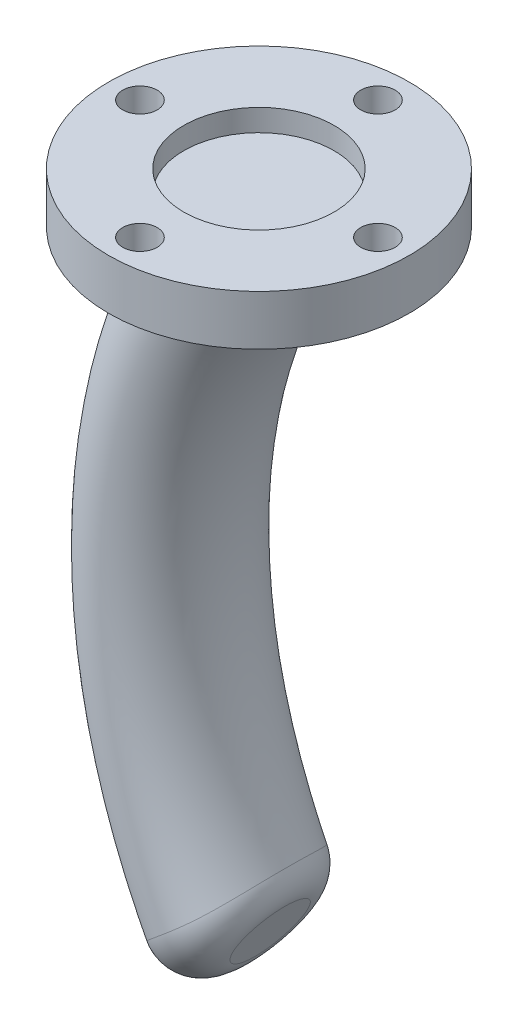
ISO-10303-21;
HEADER;
FILE_DESCRIPTION(('STEP AP214'),'2;1');
FILE_NAME('part.step','',(''),(''),'','','');
FILE_SCHEMA(('AUTOMOTIVE_DESIGN { 1 0 10303 214 1 1 1 1 }'));
ENDSEC;
DATA;
#1=APPLICATION_CONTEXT('core data for automotive mechanical design processes');
#2=APPLICATION_PROTOCOL_DEFINITION('international standard','automotive_design',2000,#1);
#3=PRODUCT_CONTEXT('',#1,'mechanical');
#4=PRODUCT('Part','Part','',(#3));
#5=PRODUCT_RELATED_PRODUCT_CATEGORY('part','',(#4));
#6=PRODUCT_DEFINITION_FORMATION('','',#4);
#7=PRODUCT_DEFINITION_CONTEXT('part definition',#1,'design');
#8=PRODUCT_DEFINITION('design','',#6,#7);
#9=PRODUCT_DEFINITION_SHAPE('','',#8);
#10=(LENGTH_UNIT() NAMED_UNIT(*) SI_UNIT(.MILLI.,.METRE.));
#11=(NAMED_UNIT(*) PLANE_ANGLE_UNIT() SI_UNIT($,.RADIAN.));
#12=(NAMED_UNIT(*) SI_UNIT($,.STERADIAN.) SOLID_ANGLE_UNIT());
#13=UNCERTAINTY_MEASURE_WITH_UNIT(LENGTH_MEASURE(1.E-05),#10,'distance_accuracy_value','');
#14=(GEOMETRIC_REPRESENTATION_CONTEXT(3) GLOBAL_UNCERTAINTY_ASSIGNED_CONTEXT((#13)) GLOBAL_UNIT_ASSIGNED_CONTEXT((#10,
#11,#12)) REPRESENTATION_CONTEXT('',''));
#15=CARTESIAN_POINT('',(0.,0.,0.));
#16=DIRECTION('',(0.,0.,1.));
#17=DIRECTION('',(1.,0.,0.));
#18=AXIS2_PLACEMENT_3D('',#15,#16,#17);
#19=CARTESIAN_POINT('',(0.,8.,0.));
#20=DIRECTION('',(0.,-1.,0.));
#21=DIRECTION('',(0.,0.,-1.));
#22=AXIS2_PLACEMENT_3D('',#19,#20,#21);
#23=CYLINDRICAL_SURFACE('',#22,24.);
#24=CARTESIAN_POINT('',(0.,8.,0.));
#25=DIRECTION('',(0.,1.,0.));
#26=DIRECTION('',(0.,0.,1.));
#27=AXIS2_PLACEMENT_3D('',#24,#25,#26);
#28=CIRCLE('',#27,24.);
#29=CARTESIAN_POINT('',(0.,8.,24.));
#30=VERTEX_POINT('',#29);
#31=EDGE_CURVE('E77',#30,#30,#28,.T.);
#32=ORIENTED_EDGE('',*,*,#31,.F.);
#33=EDGE_LOOP('',(#32));
#34=FACE_BOUND('',#33,.T.);
#35=CARTESIAN_POINT('',(0.,0.,0.));
#36=DIRECTION('',(0.,1.,0.));
#37=DIRECTION('',(0.,0.,1.));
#38=AXIS2_PLACEMENT_3D('',#35,#36,#37);
#39=CIRCLE('',#38,24.);
#40=CARTESIAN_POINT('',(0.,0.,24.));
#41=VERTEX_POINT('',#40);
#42=EDGE_CURVE('E79',#41,#41,#39,.T.);
#43=ORIENTED_EDGE('',*,*,#42,.T.);
#44=EDGE_LOOP('',(#43));
#45=FACE_BOUND('',#44,.T.);
#46=ADVANCED_FACE('F33',(#34,#45),#23,.T.);
#47=CARTESIAN_POINT('',(0.,8.,0.));
#48=DIRECTION('',(0.,1.,0.));
#49=DIRECTION('',(0.,0.,1.));
#50=AXIS2_PLACEMENT_3D('',#47,#48,#49);
#51=PLANE('',#50);
#52=CARTESIAN_POINT('',(1.99014436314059E-13,8.,-19.));
#53=DIRECTION('',(0.,1.,0.));
#54=DIRECTION('',(0.,0.,1.));
#55=AXIS2_PLACEMENT_3D('',#52,#53,#54);
#56=CIRCLE('',#55,2.75);
#57=CARTESIAN_POINT('',(1.99014436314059E-13,8.,-16.25));
#58=VERTEX_POINT('',#57);
#59=EDGE_CURVE('E110',#58,#58,#56,.T.);
#60=ORIENTED_EDGE('',*,*,#59,.F.);
#61=EDGE_LOOP('',(#60));
#62=FACE_BOUND('',#61,.T.);
#63=CARTESIAN_POINT('',(-19.,8.,-1.32676290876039E-13));
#64=DIRECTION('',(0.,1.,0.));
#65=DIRECTION('',(0.,0.,1.));
#66=AXIS2_PLACEMENT_3D('',#63,#64,#65);
#67=CIRCLE('',#66,2.75);
#68=CARTESIAN_POINT('',(-19.,8.,2.74999999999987));
#69=VERTEX_POINT('',#68);
#70=EDGE_CURVE('E104',#69,#69,#67,.T.);
#71=ORIENTED_EDGE('',*,*,#70,.F.);
#72=EDGE_LOOP('',(#71));
#73=FACE_BOUND('',#72,.T.);
#74=CARTESIAN_POINT('',(0.,8.,19.));
#75=DIRECTION('',(0.,1.,0.));
#76=DIRECTION('',(0.,0.,1.));
#77=AXIS2_PLACEMENT_3D('',#74,#75,#76);
#78=CIRCLE('',#77,2.75);
#79=CARTESIAN_POINT('',(0.,8.,21.75));
#80=VERTEX_POINT('',#79);
#81=EDGE_CURVE('E98',#80,#80,#78,.T.);
#82=ORIENTED_EDGE('',*,*,#81,.F.);
#83=EDGE_LOOP('',(#82));
#84=FACE_BOUND('',#83,.T.);
#85=CARTESIAN_POINT('',(19.,8.,0.));
#86=DIRECTION('',(0.,1.,0.));
#87=DIRECTION('',(0.,0.,1.));
#88=AXIS2_PLACEMENT_3D('',#85,#86,#87);
#89=CIRCLE('',#88,2.75);
#90=CARTESIAN_POINT('',(19.,8.,2.75));
#91=VERTEX_POINT('',#90);
#92=EDGE_CURVE('E92',#91,#91,#89,.T.);
#93=ORIENTED_EDGE('',*,*,#92,.F.);
#94=EDGE_LOOP('',(#93));
#95=FACE_BOUND('',#94,.T.);
#96=CARTESIAN_POINT('',(0.,8.,0.));
#97=DIRECTION('',(0.,1.,0.));
#98=DIRECTION('',(0.,0.,1.));
#99=AXIS2_PLACEMENT_3D('',#96,#97,#98);
#100=CIRCLE('',#99,12.);
#101=CARTESIAN_POINT('',(0.,8.,12.));
#102=VERTEX_POINT('',#101);
#103=EDGE_CURVE('E85',#102,#102,#100,.T.);
#104=ORIENTED_EDGE('',*,*,#103,.F.);
#105=EDGE_LOOP('',(#104));
#106=FACE_BOUND('',#105,.T.);
#107=ORIENTED_EDGE('',*,*,#31,.T.);
#108=EDGE_LOOP('',(#107));
#109=FACE_BOUND('',#108,.T.);
#110=ADVANCED_FACE('F69',(#62,#73,#84,#95,#106,#109),#51,.T.);
#111=CARTESIAN_POINT('',(0.,0.,0.));
#112=DIRECTION('',(0.,1.,0.));
#113=DIRECTION('',(0.,0.,1.));
#114=AXIS2_PLACEMENT_3D('',#111,#112,#113);
#115=PLANE('',#114);
#116=CARTESIAN_POINT('',(0.,0.,0.));
#117=DIRECTION('',(0.,-1.,0.));
#118=DIRECTION('',(0.,0.,-1.));
#119=AXIS2_PLACEMENT_3D('',#116,#117,#118);
#120=CIRCLE('',#119,12.);
#121=CARTESIAN_POINT('',(0.,0.,-12.));
#122=VERTEX_POINT('',#121);
#123=EDGE_CURVE('E48',#122,#122,#120,.T.);
#124=ORIENTED_EDGE('',*,*,#123,.F.);
#125=EDGE_LOOP('',(#124));
#126=FACE_BOUND('',#125,.T.);
#127=ORIENTED_EDGE('',*,*,#42,.F.);
#128=EDGE_LOOP('',(#127));
#129=FACE_BOUND('',#128,.T.);
#130=ADVANCED_FACE('F66',(#126,#129),#115,.F.);
#131=CARTESIAN_POINT('',(0.,-100.,0.));
#132=DIRECTION('',(0.891093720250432,-0.453819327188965,0.));
#133=DIRECTION('',(0.,0.,-1.));
#134=AXIS2_PLACEMENT_3D('',#131,#132,#133);
#135=CIRCLE('',#134,12.);
#136=CARTESIAN_POINT('',(81.5749956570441,-50.,0.));
#137=DIRECTION('',(0.,0.,-1.));
#138=AXIS1_PLACEMENT('',#136,#137);
#139=SURFACE_OF_REVOLUTION('',#135,#138);
#140=CARTESIAN_POINT('',(3.43602904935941,-93.2532095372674,-4.14432950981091));
#141=CARTESIAN_POINT('',(3.99931050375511,-92.1471822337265,-5.14287693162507));
#142=CARTESIAN_POINT('',(3.78427376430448,-90.828212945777,-6.00991704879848));
#143=CARTESIAN_POINT('',(3.56923702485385,-89.5092436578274,-6.8769571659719));
#144=CARTESIAN_POINT('',(2.63252216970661,-88.324745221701,-7.38411402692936));
#145=CARTESIAN_POINT('',(3.39418464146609,-93.3353728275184,-4.25894178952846));
#146=CARTESIAN_POINT('',(3.9514148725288,-92.2412273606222,-5.29800743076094));
#147=CARTESIAN_POINT('',(3.71748615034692,-90.9287201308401,-6.19773611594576));
#148=CARTESIAN_POINT('',(3.48347501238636,-89.6163369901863,-7.09769743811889));
#149=CARTESIAN_POINT('',(2.52097261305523,-88.4373833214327,-7.61721102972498));
#150=CARTESIAN_POINT('',(3.35039402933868,-93.4213575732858,-4.370088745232));
#151=CARTESIAN_POINT('',(3.90095590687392,-92.3403057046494,-5.45085426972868));
#152=CARTESIAN_POINT('',(3.64638672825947,-91.0349723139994,-6.38396469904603));
#153=CARTESIAN_POINT('',(3.39170499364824,-89.7298057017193,-7.31734938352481));
#154=CARTESIAN_POINT('',(2.40136186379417,-88.5568132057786,-7.84832480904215));
#155=CARTESIAN_POINT('',(3.2590116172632,-93.600790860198,-4.58452899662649));
#156=CARTESIAN_POINT('',(3.7946411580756,-92.5490592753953,-5.75161755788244));
#157=CARTESIAN_POINT('',(3.494577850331,-91.2597806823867,-6.75279694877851));
#158=CARTESIAN_POINT('',(3.19440100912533,-89.9706701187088,-7.75425138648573));
#159=CARTESIAN_POINT('',(2.14375042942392,-88.810374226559,-8.30535558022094));
#160=CARTESIAN_POINT('',(3.21142018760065,-93.6942386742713,-4.68782305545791));
#161=CARTESIAN_POINT('',(3.73876344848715,-92.6587775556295,-5.89956788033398));
#162=CARTESIAN_POINT('',(3.41386933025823,-91.3783356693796,-6.93540096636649));
#163=CARTESIAN_POINT('',(3.08882112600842,-90.0981178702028,-7.9715572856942));
#164=CARTESIAN_POINT('',(2.00575153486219,-88.9445039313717,-8.53127307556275));
#165=CARTESIAN_POINT('',(3.11260718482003,-93.8882622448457,-4.88542587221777));
#166=CARTESIAN_POINT('',(3.6213463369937,-92.8893310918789,-6.18979003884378));
#167=CARTESIAN_POINT('',(3.24167728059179,-91.6286746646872,-7.29614520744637));
#168=CARTESIAN_POINT('',(2.86185363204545,-90.3682429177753,-8.40282382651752));
#169=CARTESIAN_POINT('',(1.70877492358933,-89.2286649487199,-8.9758081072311));
#170=CARTESIAN_POINT('',(3.06138876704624,-93.988831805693,-4.97974227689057));
#171=CARTESIAN_POINT('',(3.55978212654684,-93.0102150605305,-6.33210482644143));
#172=CARTESIAN_POINT('',(3.15020307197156,-91.7604472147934,-7.47428913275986));
#173=CARTESIAN_POINT('',(2.74041352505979,-90.5109793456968,-8.61685304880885));
#174=CARTESIAN_POINT('',(1.54981534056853,-89.3786824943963,-9.1944317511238));
#175=CARTESIAN_POINT('',(2.95545798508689,-94.1968314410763,-5.15832470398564));
#176=CARTESIAN_POINT('',(3.43053634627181,-93.2639946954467,-6.61038840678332));
#177=CARTESIAN_POINT('',(2.95487186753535,-92.0386303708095,-7.82521451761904));
#178=CARTESIAN_POINT('',(2.47899504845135,-90.8135682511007,-9.04042066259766));
#179=CARTESIAN_POINT('',(1.20765433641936,-89.6962456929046,-9.62164664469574));
#180=CARTESIAN_POINT('',(2.90074614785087,-94.3042604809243,-5.24259223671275));
#181=CARTESIAN_POINT('',(3.36281617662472,-93.3969661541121,-6.74640091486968));
#182=CARTESIAN_POINT('',(2.85101673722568,-92.1850387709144,-7.99799678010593));
#183=CARTESIAN_POINT('',(2.33892616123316,-90.9735167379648,-9.25003602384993));
#184=CARTESIAN_POINT('',(1.02445656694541,-89.8637887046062,-9.83023939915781));
#185=CARTESIAN_POINT('',(2.79773095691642,-94.5065352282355,-5.38631579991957));
#186=CARTESIAN_POINT('',(3.23295909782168,-93.6519460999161,-6.98818341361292));
#187=CARTESIAN_POINT('',(2.64814281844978,-92.467583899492,-8.30738379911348));
#188=CARTESIAN_POINT('',(2.06312726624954,-91.2834993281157,-9.62688858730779));
#189=CARTESIAN_POINT('',(0.664336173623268,-90.1875689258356,-10.1982864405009));
#190=CARTESIAN_POINT('',(2.74993732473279,-94.6003800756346,-5.44754864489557));
#191=CARTESIAN_POINT('',(3.1717988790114,-93.7720368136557,-7.09521375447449));
#192=CARTESIAN_POINT('',(2.55134815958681,-92.6011773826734,-8.44511187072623));
#193=CARTESIAN_POINT('',(1.93063807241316,-91.4306724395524,-9.7953519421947));
#194=CARTESIAN_POINT('',(0.491723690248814,-90.3408188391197,-10.3600335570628));
#195=CARTESIAN_POINT('',(2.65229387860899,-94.792107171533,-5.56146501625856));
#196=CARTESIAN_POINT('',(3.04459623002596,-94.0218046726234,-7.3031545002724));
#197=CARTESIAN_POINT('',(2.3469637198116,-92.8804782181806,-8.71401309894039));
#198=CARTESIAN_POINT('',(1.64907085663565,-91.73950749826,-10.1252135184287));
#199=CARTESIAN_POINT('',(0.126124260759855,-90.6610699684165,-10.6697148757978));
#200=CARTESIAN_POINT('',(2.60244429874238,-94.8899889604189,-5.61414951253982));
#201=CARTESIAN_POINT('',(2.97851710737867,-94.1515538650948,-7.40409054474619));
#202=CARTESIAN_POINT('',(2.23937516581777,-93.0261841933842,-8.8451869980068));
#203=CARTESIAN_POINT('',(1.4998975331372,-91.9012649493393,-10.2866588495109));
#204=CARTESIAN_POINT('',(-0.06686036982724,-90.8280696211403,-10.8176506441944));
#205=CARTESIAN_POINT('',(2.50097833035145,-95.0892217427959,-5.71013460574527));
#206=CARTESIAN_POINT('',(2.84127834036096,-94.4210280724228,-7.59829837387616));
#207=CARTESIAN_POINT('',(2.01275025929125,-93.3303224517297,-9.09835973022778));
#208=CARTESIAN_POINT('',(1.18388714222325,-92.2400665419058,-10.5987949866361));
#209=CARTESIAN_POINT('',(-0.473370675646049,-91.1756800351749,-11.0945425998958));
#210=CARTESIAN_POINT('',(2.44936398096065,-95.1905687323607,-5.75344563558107));
#211=CARTESIAN_POINT('',(2.77007968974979,-94.5608296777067,-7.69159796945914));
#212=CARTESIAN_POINT('',(1.89372684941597,-93.4887403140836,-9.22036866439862));
#213=CARTESIAN_POINT('',(1.01694925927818,-92.4172120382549,-10.7495333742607));
#214=CARTESIAN_POINT('',(-0.686873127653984,-91.3562753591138,-11.2235198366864));
#215=CARTESIAN_POINT('',(2.34461935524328,-95.3962392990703,-5.83003223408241));
#216=CARTESIAN_POINT('',(2.62245986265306,-94.8506875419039,-7.86859975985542));
#217=CARTESIAN_POINT('',(1.64410369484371,-93.8186075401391,-9.4518605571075));
#218=CARTESIAN_POINT('',(0.665323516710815,-92.7870880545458,-11.0355144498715));
#219=CARTESIAN_POINT('',(-1.1328078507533,-91.7300955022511,-11.4566512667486));
#220=CARTESIAN_POINT('',(2.29148910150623,-95.5005628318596,-5.86330795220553));
#221=CARTESIAN_POINT('',(2.54598917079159,-95.0008410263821,-7.95230744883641));
#222=CARTESIAN_POINT('',(1.51350412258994,-93.9900567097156,-9.56134370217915));
#223=CARTESIAN_POINT('',(0.480499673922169,-92.9799511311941,-11.1707660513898));
#224=CARTESIAN_POINT('',(-1.36523983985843,-91.9233201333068,-11.5608058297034));
#225=CARTESIAN_POINT('',(2.18386517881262,-95.7118870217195,-5.91937139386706));
#226=CARTESIAN_POINT('',(2.38781392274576,-95.3114249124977,-8.10779798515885));
#227=CARTESIAN_POINT('',(1.24144259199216,-94.3457304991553,-9.76386289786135));
#228=CARTESIAN_POINT('',(0.0945490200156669,-93.3807191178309,-11.4203171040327));
#229=CARTESIAN_POINT('',(-1.84510799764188,-92.3203606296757,-11.7386470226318));
#230=CARTESIAN_POINT('',(2.12936677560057,-95.818896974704,-5.94211512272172));
#231=CARTESIAN_POINT('',(2.30604138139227,-95.4719888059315,-8.17951067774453));
#232=CARTESIAN_POINT('',(1.09993789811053,-94.5300050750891,-9.85682897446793));
#233=CARTESIAN_POINT('',(-0.106772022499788,-93.5888105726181,-11.5344894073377));
#234=CARTESIAN_POINT('',(-2.09260230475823,-92.524217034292,-11.8122057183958));
#235=CARTESIAN_POINT('',(2.01965776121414,-96.0343153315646,-5.97660503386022));
#236=CARTESIAN_POINT('',(2.13841104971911,-95.8011381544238,-8.30772528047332));
#237=CARTESIAN_POINT('',(0.809389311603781,-94.9081967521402,-10.021394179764));
#238=CARTESIAN_POINT('',(-0.520238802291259,-94.0160447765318,-11.7354078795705));
#239=CARTESIAN_POINT('',(-2.59376065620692,-92.9372129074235,-11.9240433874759));
#240=CARTESIAN_POINT('',(1.96444714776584,-96.1427237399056,-5.98835118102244));
#241=CARTESIAN_POINT('',(2.05251504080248,-95.9697986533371,-8.36417950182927));
#242=CARTESIAN_POINT('',(0.660345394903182,-95.1021138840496,-10.0929932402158));
#243=CARTESIAN_POINT('',(-0.732481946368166,-94.2352876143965,-11.8220642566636));
#244=CARTESIAN_POINT('',(-2.8474247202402,-93.1463523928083,-11.9623222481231));
#245=CARTESIAN_POINT('',(1.85374292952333,-96.3600962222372,-6.00087433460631));
#246=CARTESIAN_POINT('',(1.87789582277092,-96.3126709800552,-8.45961099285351));
#247=CARTESIAN_POINT('',(0.358477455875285,-95.4960808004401,-10.2117869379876));
#248=CARTESIAN_POINT('',(-1.16160240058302,-94.6803537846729,-11.9642247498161));
#249=CARTESIAN_POINT('',(-3.3521165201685,-93.5648174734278,-12.0028898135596));
#250=CARTESIAN_POINT('',(1.79824918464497,-96.4690605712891,-6.00164524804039));
#251=CARTESIAN_POINT('',(1.78915176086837,-96.4869237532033,-8.49850550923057));
#252=CARTESIAN_POINT('',(0.205651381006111,-95.6961339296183,-10.2589680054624));
#253=CARTESIAN_POINT('',(-1.37851950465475,-94.9062271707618,-12.0195802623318));
#254=CARTESIAN_POINT('',(-3.60314271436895,-93.7741431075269,-12.005158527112));
#255=CARTESIAN_POINT('',(1.68744604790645,-96.6866272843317,-5.99252396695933));
#256=CARTESIAN_POINT('',(1.61032045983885,-96.8380666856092,-8.5576053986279));
#257=CARTESIAN_POINT('',(-0.0999433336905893,-96.0984682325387,-10.3278066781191));
#258=CARTESIAN_POINT('',(-1.81088269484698,-95.3597589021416,-12.0981614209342));
#259=CARTESIAN_POINT('',(-4.09506334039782,-94.1883930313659,-11.9763077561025));
#260=CARTESIAN_POINT('',(1.63213665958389,-96.7952296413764,-5.98263156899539));
#261=CARTESIAN_POINT('',(1.52023400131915,-97.0149553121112,-8.57772549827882));
#262=CARTESIAN_POINT('',(-0.252711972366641,-96.3007494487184,-10.3494637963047));
#263=CARTESIAN_POINT('',(-2.02630592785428,-95.5874080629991,-12.121241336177));
#264=CARTESIAN_POINT('',(-4.33595757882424,-94.3933172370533,-11.9451876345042));
#265=CARTESIAN_POINT('',(1.52508727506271,-97.005425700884,-5.95351731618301));
#266=CARTESIAN_POINT('',(1.34492205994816,-97.3591878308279,-8.59865619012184));
#267=CARTESIAN_POINT('',(-0.547078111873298,-96.693360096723,-10.367453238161));
#268=CARTESIAN_POINT('',(-2.43966277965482,-96.028311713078,-12.1362863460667));
#269=CARTESIAN_POINT('',(-4.79044704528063,-94.7848235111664,-11.8565652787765));
#270=CARTESIAN_POINT('',(1.47331675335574,-97.1070793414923,-5.93483212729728));
#271=CARTESIAN_POINT('',(1.25969391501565,-97.5265369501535,-8.60038762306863));
#272=CARTESIAN_POINT('',(-0.688831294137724,-96.8837412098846,-10.3650988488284));
#273=CARTESIAN_POINT('',(-2.63789895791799,-96.2416795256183,-12.129760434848));
#274=CARTESIAN_POINT('',(-5.00481443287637,-94.9717969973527,-11.8005899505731));
#275=CARTESIAN_POINT('',(1.37057027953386,-97.3088264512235,-5.88890564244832));
#276=CARTESIAN_POINT('',(1.09002577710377,-97.8596876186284,-8.58770805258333));
#277=CARTESIAN_POINT('',(-0.968140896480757,-97.2616591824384,-10.339621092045));
#278=CARTESIAN_POINT('',(-3.02685309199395,-96.6643687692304,-12.0914845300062));
#279=CARTESIAN_POINT('',(-5.41891813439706,-95.3377741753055,-11.6669325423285));
#280=CARTESIAN_POINT('',(1.31959428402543,-97.4089200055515,-5.86166481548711));
#281=CARTESIAN_POINT('',(1.00560781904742,-98.0254459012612,-8.57323623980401));
#282=CARTESIAN_POINT('',(-1.10569754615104,-97.4491961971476,-10.3164988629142));
#283=CARTESIAN_POINT('',(-3.21749851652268,-96.8736272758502,-12.0596415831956));
#284=CARTESIAN_POINT('',(-5.61865524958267,-95.5167783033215,-11.5892516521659));
#285=CARTESIAN_POINT('',(1.21866035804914,-97.6071080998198,-5.79914610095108));
#286=CARTESIAN_POINT('',(0.838166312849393,-98.3542244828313,-8.52903958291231));
#287=CARTESIAN_POINT('',(-1.37574141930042,-97.8201091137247,-10.2511821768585));
#288=CARTESIAN_POINT('',(-3.590147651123,-97.28667839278,-11.9732042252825));
#289=CARTESIAN_POINT('',(-6.00335065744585,-95.8662796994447,-11.4158309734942));
#290=CARTESIAN_POINT('',(1.16870264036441,-97.7052022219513,-5.7638665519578));
#291=CARTESIAN_POINT('',(0.755169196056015,-98.5171928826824,-8.49926074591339));
#292=CARTESIAN_POINT('',(-1.50822758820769,-98.00348414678,-10.2089837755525));
#293=CARTESIAN_POINT('',(-3.77207092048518,-97.4903978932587,-11.9185318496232));
#294=CARTESIAN_POINT('',(-6.1883058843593,-96.0367752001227,-11.3200874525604));
#295=CARTESIAN_POINT('',(1.07001433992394,-97.8989809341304,-5.68578089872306));
#296=CARTESIAN_POINT('',(0.591044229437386,-98.8394592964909,-8.42543229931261));
#297=CARTESIAN_POINT('',(-1.76764277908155,-98.3651204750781,-10.1072021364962));
#298=CARTESIAN_POINT('',(-4.12677825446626,-97.8914068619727,-11.788795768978));
#299=CARTESIAN_POINT('',(-6.54397235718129,-96.3691044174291,-11.1135683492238));
#300=CARTESIAN_POINT('',(1.02128385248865,-97.9946653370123,-5.64297421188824));
#301=CARTESIAN_POINT('',(0.509943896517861,-98.9987032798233,-8.38134157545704));
#302=CARTESIAN_POINT('',(-1.89457136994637,-98.5433813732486,-10.0476175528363));
#303=CARTESIAN_POINT('',(-4.29948479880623,-98.0886225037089,-11.7136764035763));
#304=CARTESIAN_POINT('',(-6.71468249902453,-96.5309374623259,-11.002791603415));
#305=CARTESIAN_POINT('',(0.917662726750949,-98.1981298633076,-5.54301636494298));
#306=CARTESIAN_POINT('',(0.337325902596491,-99.3376461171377,-8.27183456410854));
#307=CARTESIAN_POINT('',(-2.16218804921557,-98.9217557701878,-9.90197481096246));
#308=CARTESIAN_POINT('',(-4.66223775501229,-98.506622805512,-11.5318239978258));
#309=CARTESIAN_POINT('',(-7.06857859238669,-96.8708410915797,-10.750168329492));
#310=CARTESIAN_POINT('',(0.863009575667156,-98.3054436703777,-5.48466792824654));
#311=CARTESIAN_POINT('',(0.246267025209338,-99.516444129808,-8.20414248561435));
#312=CARTESIAN_POINT('',(-2.3018978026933,-99.1208932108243,-9.81322606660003));
#313=CARTESIAN_POINT('',(-4.8505261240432,-98.7260075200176,-11.4219745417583));
#314=CARTESIAN_POINT('',(-7.24949979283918,-97.0474588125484,-10.6061758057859));
#315=CARTESIAN_POINT('',(0.755816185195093,-98.5159224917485,-5.35921253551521));
#316=CARTESIAN_POINT('',(0.0675406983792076,-99.8673809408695,-8.0523185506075));
#317=CARTESIAN_POINT('',(-2.57348091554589,-99.5107322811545,-9.61658528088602));
#318=CARTESIAN_POINT('',(-5.21496772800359,-99.1547514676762,-11.1805146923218));
#319=CARTESIAN_POINT('',(-7.5949796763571,-97.3895096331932,-10.3041159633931));
#320=CARTESIAN_POINT('',(0.703276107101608,-98.6190871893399,-5.29210491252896));
#321=CARTESIAN_POINT('',(-0.0200866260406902,-100.039440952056,-7.96815300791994));
#322=CARTESIAN_POINT('',(-2.70535367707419,-99.7014332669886,-9.50869178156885));
#323=CARTESIAN_POINT('',(-5.39102083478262,-99.364007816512,-11.0488661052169));
#324=CARTESIAN_POINT('',(-7.75953711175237,-97.5549418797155,-10.1460475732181));
#325=CARTESIAN_POINT('',(0.600500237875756,-98.820892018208,-5.14973831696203));
#326=CARTESIAN_POINT('',(-0.191630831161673,-100.37627535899,-7.78459284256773));
#327=CARTESIAN_POINT('',(-2.96129668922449,-100.073899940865,-9.27549318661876));
#328=CARTESIAN_POINT('',(-5.7313640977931,-99.7721089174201,-10.7660275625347));
#329=CARTESIAN_POINT('',(-8.07377066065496,-97.8749816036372,-9.81791874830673));
#330=CARTESIAN_POINT('',(0.55026520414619,-98.9195306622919,-5.07447669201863));
#331=CARTESIAN_POINT('',(-0.27550935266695,-100.54097443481,-7.68517264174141));
#332=CARTESIAN_POINT('',(-3.08536438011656,-100.255662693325,-9.15018242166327));
#333=CARTESIAN_POINT('',(-5.89556287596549,-99.9708569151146,-10.6148118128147));
#334=CARTESIAN_POINT('',(-8.22344190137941,-98.029585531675,-9.64785441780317));
#335=CARTESIAN_POINT('',(0.452302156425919,-99.1118853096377,-4.91640437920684));
#336=CARTESIAN_POINT('',(-0.439225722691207,-100.862438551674,-7.47224159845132));
#337=CARTESIAN_POINT('',(-3.32567206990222,-100.609712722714,-8.88369547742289));
#338=CARTESIAN_POINT('',(-6.21246271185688,-100.357494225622,-10.2947670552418));
#339=CARTESIAN_POINT('',(-8.50910041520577,-98.328182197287,-9.29741535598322));
#340=CARTESIAN_POINT('',(0.404574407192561,-99.2056007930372,-4.83359289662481));
#341=CARTESIAN_POINT('',(-0.519028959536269,-101.019135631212,-7.3587181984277));
#342=CARTESIAN_POINT('',(-3.44191124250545,-100.781998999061,-8.74251762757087));
#343=CARTESIAN_POINT('',(-6.36508583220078,-100.545297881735,-10.1259297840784));
#344=CARTESIAN_POINT('',(-8.64508624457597,-98.4721738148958,-9.11703954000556));
#345=CARTESIAN_POINT('',(0.304162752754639,-99.4027633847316,-4.6467616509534));
#346=CARTESIAN_POINT('',(-0.687130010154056,-101.349209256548,-7.09878353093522));
#347=CARTESIAN_POINT('',(-3.6850538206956,-101.14418582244,-8.42118965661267));
#348=CARTESIAN_POINT('',(-6.68337585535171,-100.939755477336,-9.74307063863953));
#349=CARTESIAN_POINT('',(-8.92577394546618,-98.7725913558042,-8.71683655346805));
#350=CARTESIAN_POINT('',(0.251955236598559,-99.5052750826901,-4.54149411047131));
#351=CARTESIAN_POINT('',(-0.774577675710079,-101.520916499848,-6.95009442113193));
#352=CARTESIAN_POINT('',(-3.81056564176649,-101.332321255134,-8.23844901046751));
#353=CARTESIAN_POINT('',(-6.84688012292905,-101.144217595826,-9.52628590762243));
#354=CARTESIAN_POINT('',(-9.06822928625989,-98.9271657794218,-8.4954009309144));
#355=CARTESIAN_POINT('',(0.151432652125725,-99.7026554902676,-4.3223298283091));
#356=CARTESIAN_POINT('',(-0.943182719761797,-101.851979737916,-6.6365484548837));
#357=CARTESIAN_POINT('',(-4.05091346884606,-101.694402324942,-7.85519440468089));
#358=CARTESIAN_POINT('',(-7.1589700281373,-101.537316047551,-9.07331785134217));
#359=CARTESIAN_POINT('',(-9.33733165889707,-99.2223746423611,-8.04199794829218));
#360=CARTESIAN_POINT('',(0.103117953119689,-99.797523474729,-4.20843226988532));
#361=CARTESIAN_POINT('',(-1.02429495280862,-102.011247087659,-6.47169706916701));
#362=CARTESIAN_POINT('',(-4.16574846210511,-101.868346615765,-7.65467876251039));
#363=CARTESIAN_POINT('',(-7.30746287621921,-101.725843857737,-8.83715357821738));
#364=CARTESIAN_POINT('',(-9.46397719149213,-99.3630077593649,-7.81002959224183));
#365=CARTESIAN_POINT('',(-0.0356668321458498,-100.070033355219,-3.85490668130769));
#366=CARTESIAN_POINT('',(-1.25792324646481,-102.469986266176,-5.95429100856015));
#367=CARTESIAN_POINT('',(-4.49418212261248,-102.367970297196,-7.02889978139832));
#368=CARTESIAN_POINT('',(-7.73150495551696,-102.267571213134,-8.10150094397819));
#369=CARTESIAN_POINT('',(-9.82191912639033,-99.7642574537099,-7.10020139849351));
#370=CARTESIAN_POINT('',(-0.120013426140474,-100.235651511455,-3.60337863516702));
#371=CARTESIAN_POINT('',(-1.39999354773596,-102.748947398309,-5.58014026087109));
#372=CARTESIAN_POINT('',(-4.69179554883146,-102.67156947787,-6.57928849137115));
#373=CARTESIAN_POINT('',(-7.98424695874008,-102.595193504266,-7.57668365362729));
#374=CARTESIAN_POINT('',(-10.031318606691,-100.004330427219,-6.60827507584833));
#375=CARTESIAN_POINT('',(-0.277424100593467,-100.544734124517,-3.05127365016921));
#376=CARTESIAN_POINT('',(-1.66608245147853,-103.271424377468,-4.74767493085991));
#377=CARTESIAN_POINT('',(-5.05874184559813,-103.238566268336,-5.58553369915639));
#378=CARTESIAN_POINT('',(-8.45217536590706,-103.2069059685,-6.42128981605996));
#379=CARTESIAN_POINT('',(-10.4138013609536,-100.448506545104,-5.5505594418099));
#380=CARTESIAN_POINT('',(-0.348762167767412,-100.684809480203,-2.74831606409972));
#381=CARTESIAN_POINT('',(-1.78692191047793,-103.508697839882,-4.28527497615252));
#382=CARTESIAN_POINT('',(-5.22386274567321,-103.495788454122,-5.03651060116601));
#383=CARTESIAN_POINT('',(-8.66119136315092,-103.483484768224,-5.78614587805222));
#384=CARTESIAN_POINT('',(-10.5818435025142,-100.647345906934,-4.98212272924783));
#385=CARTESIAN_POINT('',(-0.468221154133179,-100.919372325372,-2.12088807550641));
#386=CARTESIAN_POINT('',(-1.98992697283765,-103.907306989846,-3.31859464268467));
#387=CARTESIAN_POINT('',(-5.4995747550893,-103.926939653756,-3.8940889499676));
#388=CARTESIAN_POINT('',(-9.00960898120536,-103.947177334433,-4.46797555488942));
#389=CARTESIAN_POINT('',(-10.859237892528,-100.978457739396,-3.82188966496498));
#390=CARTESIAN_POINT('',(-0.516337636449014,-101.013851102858,-1.79641357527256));
#391=CARTESIAN_POINT('',(-2.07185391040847,-104.068174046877,-2.81477101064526));
#392=CARTESIAN_POINT('',(-5.61015544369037,-104.100852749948,-3.30068194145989));
#393=CARTESIAN_POINT('',(-9.14859124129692,-104.133742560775,-3.78559973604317));
#394=CARTESIAN_POINT('',(-10.9685789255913,-101.110717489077,-3.23008887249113));
#395=CARTESIAN_POINT('',(-0.589380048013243,-101.15727301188,-1.12337806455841));
#396=CARTESIAN_POINT('',(-2.19650696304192,-104.312935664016,-1.76397277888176));
#397=CARTESIAN_POINT('',(-5.77782578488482,-104.365022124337,-2.06655770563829));
#398=CARTESIAN_POINT('',(-9.35929023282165,-104.417338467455,-2.3680758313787));
#399=CARTESIAN_POINT('',(-11.1334660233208,-101.310984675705,-2.01241944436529));
#400=CARTESIAN_POINT('',(-0.613466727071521,-101.204568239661,-0.774373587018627));
#401=CARTESIAN_POINT('',(-2.23766029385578,-104.39374199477,-1.216745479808));
#402=CARTESIAN_POINT('',(-5.83298009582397,-104.452250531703,-1.42491920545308));
#403=CARTESIAN_POINT('',(-9.42831216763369,-104.510778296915,-1.6327835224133));
#404=CARTESIAN_POINT('',(-11.1870678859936,-101.376668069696,-1.38607551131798));
#405=CARTESIAN_POINT('',(-0.634913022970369,-101.246678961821,-0.0724268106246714));
#406=CARTESIAN_POINT('',(-2.27434160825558,-104.465767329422,-0.113906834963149));
#407=CARTESIAN_POINT('',(-5.88209399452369,-104.529910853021,-0.133416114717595));
#408=CARTESIAN_POINT('',(-9.48985784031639,-104.594072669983,-0.152610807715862));
#409=CARTESIAN_POINT('',(-11.2348280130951,-101.435167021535,-0.129217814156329));
#410=CARTESIAN_POINT('',(-0.632273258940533,-101.241495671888,0.280515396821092));
#411=CARTESIAN_POINT('',(-2.26982654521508,-104.456901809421,0.441045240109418));
#412=CARTESIAN_POINT('',(-5.87605499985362,-104.520345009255,0.516448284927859));
#413=CARTESIAN_POINT('',(-9.48230937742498,-104.583829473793,0.591383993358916));
#414=CARTESIAN_POINT('',(-11.2289876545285,-101.427984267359,0.501295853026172));
#415=CARTESIAN_POINT('',(-0.600221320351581,-101.178560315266,0.982988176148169));
#416=CARTESIAN_POINT('',(-2.21501951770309,-104.349285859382,1.54395478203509));
#417=CARTESIAN_POINT('',(-5.80263509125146,-104.404296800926,1.80844388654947));
#418=CARTESIAN_POINT('',(-9.39027784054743,-104.459350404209,2.07246600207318));
#419=CARTESIAN_POINT('',(-11.1575042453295,-101.340507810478,1.76050873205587));
#420=CARTESIAN_POINT('',(-0.570620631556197,-101.120438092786,1.33247718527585));
#421=CARTESIAN_POINT('',(-2.16447203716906,-104.250033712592,2.09117288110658));
#422=CARTESIAN_POINT('',(-5.73482224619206,-104.297132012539,2.45048833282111));
#423=CARTESIAN_POINT('',(-9.30536528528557,-104.344534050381,2.80857607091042));
#424=CARTESIAN_POINT('',(-11.0914400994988,-101.259699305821,2.38916385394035));
#425=CARTESIAN_POINT('',(-0.485168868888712,-100.952649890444,2.01565933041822));
#426=CARTESIAN_POINT('',(-2.0187535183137,-103.963909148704,3.15546115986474));
#427=CARTESIAN_POINT('',(-5.53849925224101,-103.988201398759,3.70176019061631));
#428=CARTESIAN_POINT('',(-9.05843720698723,-104.012795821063,4.24683280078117));
#429=CARTESIAN_POINT('',(-10.8976396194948,-101.024991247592,3.62963625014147));
#430=CARTESIAN_POINT('',(-0.429304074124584,-100.842956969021,2.34934410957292));
#431=CARTESIAN_POINT('',(-1.92373762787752,-103.777341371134,3.67190946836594));
#432=CARTESIAN_POINT('',(-5.40995737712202,-103.786386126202,4.3109702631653));
#433=CARTESIAN_POINT('',(-8.89668672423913,-103.79622789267,4.94812934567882));
#434=CARTESIAN_POINT('',(-10.7698710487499,-100.871053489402,4.24144454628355));
#435=CARTESIAN_POINT('',(-0.292779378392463,-100.5748848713,2.99088356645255));
#436=CARTESIAN_POINT('',(-1.69203493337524,-103.322383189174,4.65580186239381));
#437=CARTESIAN_POINT('',(-5.09422783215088,-103.293922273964,5.47624990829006));
#438=CARTESIAN_POINT('',(-8.49693430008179,-103.266260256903,6.29482331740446));
#439=CARTESIAN_POINT('',(-10.4497638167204,-100.491209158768,5.43680007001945));
#440=CARTESIAN_POINT('',(-0.212149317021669,-100.41656428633,3.29876876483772));
#441=CARTESIAN_POINT('',(-1.55568623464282,-103.054656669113,5.12280905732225));
#442=CARTESIAN_POINT('',(-4.90711073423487,-103.003380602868,6.03238238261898));
#443=CARTESIAN_POINT('',(-8.25953494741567,-102.953640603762,6.93957335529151));
#444=CARTESIAN_POINT('',(-10.2575028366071,-100.265389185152,6.02038033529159));
#445=CARTESIAN_POINT('',(-0.0743561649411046,-100.146001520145,3.73384670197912));
#446=CARTESIAN_POINT('',(-1.32291734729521,-102.597604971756,5.7739195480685));
#447=CARTESIAN_POINT('',(-4.584562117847,-102.507221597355,6.81195122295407));
#448=CARTESIAN_POINT('',(-7.84644898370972,-102.417211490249,7.84938092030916));
#449=CARTESIAN_POINT('',(-9.91689084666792,-99.8738757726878,6.86506772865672));
#450=CARTESIAN_POINT('',(-0.0256415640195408,-100.050348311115,3.87435992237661));
#451=CARTESIAN_POINT('',(-1.24086752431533,-102.436496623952,5.98220858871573));
#452=CARTESIAN_POINT('',(-4.47012503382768,-102.331865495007,7.06260687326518));
#453=CARTESIAN_POINT('',(-7.6997044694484,-102.2277254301,8.14236219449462));
#454=CARTESIAN_POINT('',(-9.79471357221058,-99.7346449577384,7.14140459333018));
#455=CARTESIAN_POINT('',(0.0771337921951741,-99.848544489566,4.14552129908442));
#456=CARTESIAN_POINT('',(-1.06797115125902,-102.097007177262,6.38026156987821));
#457=CARTESIAN_POINT('',(-4.22741607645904,-101.961895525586,7.54370962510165));
#458=CARTESIAN_POINT('',(-7.38718427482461,-101.827276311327,8.70652170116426));
#459=CARTESIAN_POINT('',(-9.53171050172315,-99.438465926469,7.68255788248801));
#460=CARTESIAN_POINT('',(0.131192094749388,-99.7423986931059,4.27617393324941));
#461=CARTESIAN_POINT('',(-0.977185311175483,-101.918745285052,6.57000615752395));
#462=CARTESIAN_POINT('',(-4.09915054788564,-101.767290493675,7.77416590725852));
#463=CARTESIAN_POINT('',(-7.22152805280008,-101.616457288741,8.97765867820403));
#464=CARTESIAN_POINT('',(-9.39089325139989,-99.281525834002,7.947379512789));
#465=CARTESIAN_POINT('',(0.238712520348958,-99.5312777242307,4.51402574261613));
#466=CARTESIAN_POINT('',(-0.796776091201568,-101.564504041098,6.9110996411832));
#467=CARTESIAN_POINT('',(-3.84233802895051,-101.380033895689,8.19063335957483));
#468=CARTESIAN_POINT('',(-6.88823288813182,-101.196065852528,9.46962576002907));
#469=CARTESIAN_POINT('',(-9.10411208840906,-98.9662571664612,8.43797391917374));
#470=CARTESIAN_POINT('',(0.29170206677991,-99.4272304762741,4.62226585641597));
#471=CARTESIAN_POINT('',(-0.70800415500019,-101.390196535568,7.06433511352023));
#472=CARTESIAN_POINT('',(-3.71508053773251,-101.189102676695,8.37878567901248));
#473=CARTESIAN_POINT('',(-6.7225658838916,-100.988618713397,9.69268699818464));
#474=CARTESIAN_POINT('',(-8.96004363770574,-98.8096099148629,8.66501466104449));
#475=CARTESIAN_POINT('',(0.401492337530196,-99.2116525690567,4.82891920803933));
#476=CARTESIAN_POINT('',(-0.524216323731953,-101.029321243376,7.35244849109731));
#477=CARTESIAN_POINT('',(-3.44949260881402,-100.793139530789,8.73470127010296));
#478=CARTESIAN_POINT('',(-6.3751770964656,-100.557566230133,10.1164082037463));
#479=CARTESIAN_POINT('',(-8.65415666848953,-98.4816068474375,9.1065027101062));
#480=CARTESIAN_POINT('',(0.458292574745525,-99.1001228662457,4.9273336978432));
#481=CARTESIAN_POINT('',(-0.429253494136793,-100.842857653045,7.487333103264));
#482=CARTESIAN_POINT('',(-3.31116358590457,-100.588109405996,8.90246713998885));
#483=CARTESIAN_POINT('',(-6.19356919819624,-100.334090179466,10.31706335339));
#484=CARTESIAN_POINT('',(-8.49234041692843,-98.3102529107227,9.3209516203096));
#485=CARTESIAN_POINT('',(0.5645644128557,-98.8914535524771,5.09616810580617));
#486=CARTESIAN_POINT('',(-0.251620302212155,-100.494067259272,7.71393017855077));
#487=CARTESIAN_POINT('',(-3.05008442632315,-100.203932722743,9.18637238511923));
#488=CARTESIAN_POINT('',(-5.84887603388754,-99.9142801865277,10.6584576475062));
#489=CARTESIAN_POINT('',(-8.18097259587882,-97.9856406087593,9.69670208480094));
#490=CARTESIAN_POINT('',(0.613446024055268,-98.7954724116,5.16839767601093));
#491=CARTESIAN_POINT('',(-0.17000975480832,-100.333821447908,7.80896554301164));
#492=CARTESIAN_POINT('',(-2.92919118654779,-100.027021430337,9.30631949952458));
#493=CARTESIAN_POINT('',(-5.68875377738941,-99.7207756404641,10.8033311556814));
#494=CARTESIAN_POINT('',(-8.03469647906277,-97.834905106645,9.86049294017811));
#495=CARTESIAN_POINT('',(0.713387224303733,-98.5992335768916,5.30519459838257));
#496=CARTESIAN_POINT('',(-0.00321117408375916,-100.00630527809,7.98465522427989));
#497=CARTESIAN_POINT('',(-2.68000585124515,-99.6647422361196,9.52980245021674));
#498=CARTESIAN_POINT('',(-5.35718083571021,-99.3237320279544,11.0746090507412));
#499=CARTESIAN_POINT('',(-7.72798363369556,-97.5231586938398,10.1767616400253));
#500=CARTESIAN_POINT('',(0.764447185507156,-98.4989751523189,5.36976063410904));
#501=CARTESIAN_POINT('',(0.0819435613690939,-99.8391003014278,8.0653266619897));
#502=CARTESIAN_POINT('',(-2.55171249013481,-99.4793728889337,9.63333546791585));
#503=CARTESIAN_POINT('',(-5.18580846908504,-99.1202765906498,11.2010291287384));
#504=CARTESIAN_POINT('',(-7.56754448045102,-97.3621460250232,10.3292375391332));
#505=CARTESIAN_POINT('',(0.868603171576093,-98.2944604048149,5.49070202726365));
#506=CARTESIAN_POINT('',(0.255597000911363,-99.4981243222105,8.21118402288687));
#507=CARTESIAN_POINT('',(-2.28761265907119,-99.1005166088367,9.82243509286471));
#508=CARTESIAN_POINT('',(-4.83126172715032,-98.7035392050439,11.4333716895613));
#509=CARTESIAN_POINT('',(-7.23103370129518,-97.0294061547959,10.6210194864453));
#510=CARTESIAN_POINT('',(0.921701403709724,-98.1901997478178,5.54706816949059));
#511=CARTESIAN_POINT('',(0.344063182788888,-99.3244171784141,8.27638305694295));
#512=CARTESIAN_POINT('',(-2.15179796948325,-98.9070208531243,9.90798153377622));
#513=CARTESIAN_POINT('',(-4.64816474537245,-98.4903392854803,11.5393058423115));
#514=CARTESIAN_POINT('',(-7.05494484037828,-96.857667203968,10.7603106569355));
#515=CARTESIAN_POINT('',(1.02966314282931,-97.9782122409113,5.65089419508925));
#516=CARTESIAN_POINT('',(0.523863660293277,-98.9713712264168,8.38988614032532));
#517=CARTESIAN_POINT('',(-1.87288843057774,-98.5127713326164,10.0590495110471));
#518=CARTESIAN_POINT('',(-4.27014394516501,-98.0548830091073,11.7279405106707));
#519=CARTESIAN_POINT('',(-6.68589809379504,-96.5033739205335,11.0229100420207));
#520=CARTESIAN_POINT('',(1.08452652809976,-97.8704856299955,5.69835469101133));
#521=CARTESIAN_POINT('',(0.615159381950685,-98.79210815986,8.43823454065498));
#522=CARTESIAN_POINT('',(-1.72979408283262,-98.3120180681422,10.1245724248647));
#523=CARTESIAN_POINT('',(-4.07532251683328,-97.8327278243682,11.8106969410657));
#524=CARTESIAN_POINT('',(-6.49294136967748,-96.3208203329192,11.146219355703));
#525=CARTESIAN_POINT('',(1.19365732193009,-97.6562026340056,5.78206940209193));
#526=CARTESIAN_POINT('',(0.796616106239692,-98.4358100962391,8.51515440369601));
#527=CARTESIAN_POINT('',(-1.44220998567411,-97.9119318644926,10.2313258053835));
#528=CARTESIAN_POINT('',(-3.68156548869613,-97.3887901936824,11.9473006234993));
#529=CARTESIAN_POINT('',(-6.09657943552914,-95.951915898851,11.3690854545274));
#530=CARTESIAN_POINT('',(1.24786814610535,-97.5497573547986,5.81868094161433));
#531=CARTESIAN_POINT('',(0.886640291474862,-98.2590437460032,8.54445545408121));
#532=CARTESIAN_POINT('',(-1.29797991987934,-97.7128348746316,10.2733848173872));
#533=CARTESIAN_POINT('',(-3.48319520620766,-97.1674405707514,12.0021899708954));
#534=CARTESIAN_POINT('',(-5.89384995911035,-95.7659729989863,11.4693668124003));
#535=CARTESIAN_POINT('',(1.35743503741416,-97.3346180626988,5.88238694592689));
#536=CARTESIAN_POINT('',(1.0682603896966,-97.9024248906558,8.58486546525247));
#537=CARTESIAN_POINT('',(-1.00373730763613,-97.3100270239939,10.3347805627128));
#538=CARTESIAN_POINT('',(-3.07632639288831,-96.7184388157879,12.0845723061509));
#539=CARTESIAN_POINT('',(-5.47101474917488,-95.3841899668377,11.6479765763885));
#540=CARTESIAN_POINT('',(1.41279108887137,-97.2259240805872,5.90948154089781));
#541=CARTESIAN_POINT('',(1.15982406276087,-97.722635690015,8.59604196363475));
#542=CARTESIAN_POINT('',(-0.853724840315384,-97.1063162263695,10.3541176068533));
#543=CARTESIAN_POINT('',(-2.86792670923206,-96.4908761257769,12.1121639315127));
#544=CARTESIAN_POINT('',(-5.25090925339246,-95.1883499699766,11.7263052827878));
#545=CARTESIAN_POINT('',(1.52427134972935,-97.0070278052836,5.95346246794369));
#546=CARTESIAN_POINT('',(1.34354580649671,-97.3618901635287,8.59910895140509));
#547=CARTESIAN_POINT('',(-0.549429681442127,-96.6964233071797,10.3679530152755));
#548=CARTESIAN_POINT('',(-2.44305165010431,-96.0318274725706,12.1367673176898));
#549=CARTESIAN_POINT('',(-4.79420529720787,-94.7879517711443,11.856113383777));
#550=CARTESIAN_POINT('',(1.58039457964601,-96.8968274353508,5.97036076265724));
#551=CARTESIAN_POINT('',(1.43567709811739,-97.1809864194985,8.59110351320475));
#552=CARTESIAN_POINT('',(-0.395152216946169,-96.4902443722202,10.3624805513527));
#553=CARTESIAN_POINT('',(-2.22667450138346,-95.8004216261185,12.1339415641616));
#554=CARTESIAN_POINT('',(-4.55762652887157,-94.5834040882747,11.9076242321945));
#555=CARTESIAN_POINT('',(1.69309880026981,-96.6755278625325,5.99337400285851));
#556=CARTESIAN_POINT('',(1.61944784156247,-96.8201446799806,8.55529696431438));
#557=CARTESIAN_POINT('',(-0.0844885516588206,-96.077977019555,10.3252355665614));
#558=CARTESIAN_POINT('',(-1.78911206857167,-95.3367215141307,12.095255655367));
#559=CARTESIAN_POINT('',(-4.07057939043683,-94.1675416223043,11.9787547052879));
#560=CARTESIAN_POINT('',(1.74967977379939,-96.564428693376,5.99948935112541));
#561=CARTESIAN_POINT('',(1.71107478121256,-96.6402312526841,8.52758699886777));
#562=CARTESIAN_POINT('',(0.0718975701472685,-95.8718885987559,10.2934640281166));
#563=CARTESIAN_POINT('',(-1.56798324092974,-95.1044683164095,12.0595459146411));
#564=CARTESIAN_POINT('',(-3.82011153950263,-93.9562270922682,11.9983755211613));
#565=CARTESIAN_POINT('',(1.86319515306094,-96.3415363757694,6.00045185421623));
#566=CARTESIAN_POINT('',(1.89287624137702,-96.2832562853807,8.45260860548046));
#567=CARTESIAN_POINT('',(0.384223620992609,-95.4623122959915,10.2032243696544));
#568=CARTESIAN_POINT('',(-1.12513554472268,-94.6422951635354,11.9540427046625));
#569=CARTESIAN_POINT('',(-3.30972205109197,-93.5293810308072,12.0014362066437));
#570=CARTESIAN_POINT('',(1.92012970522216,-96.2297429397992,5.9952334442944));
#571=CARTESIAN_POINT('',(1.98304883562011,-96.1061985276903,8.40531536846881));
#572=CARTESIAN_POINT('',(0.540155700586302,-95.2588464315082,10.1446024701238));
#573=CARTESIAN_POINT('',(-0.90341612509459,-94.4123783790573,11.8842059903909));
#574=CARTESIAN_POINT('',(-3.04975400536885,-93.3138321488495,11.9846655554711));
#575=CARTESIAN_POINT('',(2.03353409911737,-96.0070685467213,5.97316193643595));
#576=CARTESIAN_POINT('',(2.15979907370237,-95.7591418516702,8.2929803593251));
#577=CARTESIAN_POINT('',(0.846403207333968,-94.8599211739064,10.0026455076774));
#578=CARTESIAN_POINT('',(-0.467669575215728,-93.9615822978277,11.7126226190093));
#579=CARTESIAN_POINT('',(-2.53067995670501,-92.8850383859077,11.9129403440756));
#580=CARTESIAN_POINT('',(2.09000394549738,-95.8961875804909,5.95630895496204));
#581=CARTESIAN_POINT('',(2.24640683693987,-95.5890837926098,8.22800793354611));
#582=CARTESIAN_POINT('',(0.996718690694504,-94.6644617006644,9.91931069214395));
#583=CARTESIAN_POINT('',(-0.253573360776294,-93.740626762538,11.6110030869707));
#584=CARTESIAN_POINT('',(-2.27157394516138,-92.6717934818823,11.857986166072));
#585=CARTESIAN_POINT('',(2.20199496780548,-95.6762884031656,5.91109060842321));
#586=CARTESIAN_POINT('',(2.414762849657,-95.258509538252,8.08321266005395));
#587=CARTESIAN_POINT('',(1.28791937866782,-94.2850283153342,9.73198557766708));
#588=CARTESIAN_POINT('',(0.160470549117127,-93.3123356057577,11.3811467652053));
#589=CARTESIAN_POINT('',(-1.76378743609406,-92.2531165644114,11.7123615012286));
#590=CARTESIAN_POINT('',(2.25751596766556,-95.5672705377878,5.88272313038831));
#591=CARTESIAN_POINT('',(2.49655815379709,-95.09790094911,8.00342458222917));
#592=CARTESIAN_POINT('',(1.42880284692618,-94.1010565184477,9.627991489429));
#593=CARTESIAN_POINT('',(0.360542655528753,-93.1048753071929,11.2529772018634));
#594=CARTESIAN_POINT('',(-1.51510886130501,-92.047685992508,11.6216844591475));
#595=CARTESIAN_POINT('',(2.36714897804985,-95.3520014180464,5.81495089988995));
#596=CARTESIAN_POINT('',(2.65459413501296,-94.7875905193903,7.83217302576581));
#597=CARTESIAN_POINT('',(1.69876142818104,-93.746614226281,9.40426989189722));
#598=CARTESIAN_POINT('',(0.742422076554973,-92.7063028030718,10.9767862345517));
#599=CARTESIAN_POINT('',(-1.03556689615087,-91.6488964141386,11.4103608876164));
#600=CARTESIAN_POINT('',(2.4212609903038,-95.2457501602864,5.77554616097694));
#601=CARTESIAN_POINT('',(2.73088975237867,-94.6377808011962,7.74071609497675));
#602=CARTESIAN_POINT('',(1.8278365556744,-93.5761437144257,9.28454240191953));
#603=CARTESIAN_POINT('',(0.924380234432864,-92.5150433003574,10.8287792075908));
#604=CARTESIAN_POINT('',(-0.804703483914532,-91.4555373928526,11.28971439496));
#605=CARTESIAN_POINT('',(2.52319456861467,-95.0455992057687,5.69019852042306));
#606=CARTESIAN_POINT('',(2.87161895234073,-94.3614529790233,7.55689211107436));
#607=CARTESIAN_POINT('',(2.06313745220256,-93.2629521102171,9.04436682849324));
#608=CARTESIAN_POINT('',(1.25431823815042,-92.164900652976,10.5321871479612));
#609=CARTESIAN_POINT('',(-0.383081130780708,-91.0988387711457,11.0364763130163));
#610=CARTESIAN_POINT('',(2.57116107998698,-94.9514149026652,5.64509048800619));
#611=CARTESIAN_POINT('',(2.93653419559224,-94.2339891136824,7.46526789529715));
#612=CARTESIAN_POINT('',(2.17037244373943,-93.1191034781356,8.92483616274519));
#613=CARTESIAN_POINT('',(1.40394318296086,-92.0045796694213,10.3847261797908));
#614=CARTESIAN_POINT('',(-0.190581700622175,-90.9343433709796,10.9057580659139));
#615=CARTESIAN_POINT('',(2.66536985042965,-94.7664319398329,5.54688133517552));
#616=CARTESIAN_POINT('',(3.06179630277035,-93.9880315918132,7.27596296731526));
#617=CARTESIAN_POINT('',(2.37479414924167,-92.8426214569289,8.67881803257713));
#618=CARTESIAN_POINT('',(1.68752499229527,-91.6975724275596,10.0819946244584));
#619=CARTESIAN_POINT('',(0.17591788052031,-90.617716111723,10.6296774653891));
#620=CARTESIAN_POINT('',(2.71161223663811,-94.675633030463,5.49378080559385));
#621=CARTESIAN_POINT('',(3.12217828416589,-93.869468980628,7.17826393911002));
#622=CARTESIAN_POINT('',(2.47198160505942,-92.7099872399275,8.55233108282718));
#623=CARTESIAN_POINT('',(1.82157564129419,-91.5507935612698,9.92668971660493));
#624=CARTESIAN_POINT('',(0.349919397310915,-90.4655833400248,10.4843161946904));
#625=CARTESIAN_POINT('',(2.80221345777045,-94.497733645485,5.38022634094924));
#626=CARTESIAN_POINT('',(3.23866479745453,-93.6407427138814,6.97781073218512));
#627=CARTESIAN_POINT('',(2.65712382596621,-92.4551377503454,8.29412392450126));
#628=CARTESIAN_POINT('',(2.07537397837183,-91.2698203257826,9.61072881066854));
#629=CARTESIAN_POINT('',(0.680280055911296,-90.1733267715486,10.1826745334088));
#630=CARTESIAN_POINT('',(2.84657166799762,-94.4106343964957,5.31976999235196));
#631=CARTESIAN_POINT('',(3.29479676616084,-93.5305251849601,6.87503325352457));
#632=CARTESIAN_POINT('',(2.7450755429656,-92.3329259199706,8.16240200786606));
#633=CARTESIAN_POINT('',(2.19519104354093,-91.135555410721,9.45003104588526));
#634=CARTESIAN_POINT('',(0.836633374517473,-90.0332069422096,10.0263905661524));
#635=CARTESIAN_POINT('',(2.93325482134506,-94.2404283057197,5.19215518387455));
#636=CARTESIAN_POINT('',(3.40304514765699,-93.3179748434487,6.66516159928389));
#637=CARTESIAN_POINT('',(2.91261151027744,-92.098150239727,7.89493341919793));
#638=CARTESIAN_POINT('',(2.42201528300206,-90.8785535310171,9.12496519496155));
#639=CARTESIAN_POINT('',(1.13305817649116,-89.7643745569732,9.70575039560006));
#640=CARTESIAN_POINT('',(2.97557960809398,-94.1573217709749,5.12499620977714));
#641=CARTESIAN_POINT('',(3.45518451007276,-93.2155969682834,6.55804549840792));
#642=CARTESIAN_POINT('',(2.99219511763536,-91.9855871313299,7.75918643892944));
#643=CARTESIAN_POINT('',(2.52907874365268,-90.755758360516,8.96055752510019));
#644=CARTESIAN_POINT('',(1.27312840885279,-89.6356628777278,9.54139357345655));
#645=CARTESIAN_POINT('',(3.06379384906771,-93.9841093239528,4.97486826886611));
#646=CARTESIAN_POINT('',(3.56263523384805,-93.0046128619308,6.32495850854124));
#647=CARTESIAN_POINT('',(3.15433383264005,-91.7544106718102,7.46545169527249));
#648=CARTESIAN_POINT('',(2.74586787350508,-90.5044430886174,8.60624288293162));
#649=CARTESIAN_POINT('',(1.55691932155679,-89.371834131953,9.18349469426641));
#650=CARTESIAN_POINT('',(3.1093672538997,-93.8946239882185,4.89099715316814));
#651=CARTESIAN_POINT('',(3.61742853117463,-92.8970238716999,6.19836934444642));
#652=CARTESIAN_POINT('',(3.23577887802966,-91.6371120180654,7.30698351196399));
#653=CARTESIAN_POINT('',(2.85400454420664,-90.3773811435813,8.41585608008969));
#654=CARTESIAN_POINT('',(1.6984679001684,-89.238291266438,8.98905895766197));
#655=CARTESIAN_POINT('',(3.19761948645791,-93.7213369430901,4.71616931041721));
#656=CARTESIAN_POINT('',(3.72243917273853,-92.6908309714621,5.94082536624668));
#657=CARTESIAN_POINT('',(3.39002826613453,-91.4131104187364,6.98659968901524));
#658=CARTESIAN_POINT('',(3.0574934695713,-90.1355698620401,8.03263190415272));
#659=CARTESIAN_POINT('',(1.9647440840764,-88.9839363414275,8.5944501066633));
#660=CARTESIAN_POINT('',(3.2402981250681,-93.6375356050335,4.62521212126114));
#661=CARTESIAN_POINT('',(3.7726774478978,-92.5921859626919,5.80984328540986));
#662=CARTESIAN_POINT('',(3.46283204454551,-91.3064081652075,6.82468382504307));
#663=CARTESIAN_POINT('',(3.15289233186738,-90.0207695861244,7.83974771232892));
#664=CARTESIAN_POINT('',(2.08947059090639,-88.8631251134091,8.39427661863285));
#665=CARTESIAN_POINT('',(3.32267673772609,-93.4757816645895,4.43693500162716));
#666=CARTESIAN_POINT('',(3.86882799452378,-92.4033902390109,5.54392435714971));
#667=CARTESIAN_POINT('',(3.60071064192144,-91.1028277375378,6.49786880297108));
#668=CARTESIAN_POINT('',(3.33249927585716,-89.8024040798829,7.45203628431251));
#669=CARTESIAN_POINT('',(2.32408152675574,-88.6332575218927,7.98955474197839));
#670=CARTESIAN_POINT('',(3.36237600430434,-93.3978304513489,4.33961357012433));
#671=CARTESIAN_POINT('',(3.91475578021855,-92.3132090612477,5.4089625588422));
#672=CARTESIAN_POINT('',(3.66578362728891,-91.0059518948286,6.33296894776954));
#673=CARTESIAN_POINT('',(3.41673984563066,-89.6988020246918,7.25716835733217));
#674=CARTESIAN_POINT('',(2.43396243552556,-88.5242039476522,7.7850053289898));
#675=CARTESIAN_POINT('',(3.43871390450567,-93.2479377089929,4.13930237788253));
#676=CARTESIAN_POINT('',(4.002458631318,-92.141000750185,5.13548516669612));
#677=CARTESIAN_POINT('',(3.78890314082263,-90.8214579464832,6.0005790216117));
#678=CARTESIAN_POINT('',(3.57527643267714,-89.5020219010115,6.8658655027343));
#679=CARTESIAN_POINT('',(2.64049517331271,-88.317077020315,7.37254366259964));
#680=CARTESIAN_POINT('',(3.47535216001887,-93.1759969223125,4.0363119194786));
#681=CARTESIAN_POINT('',(4.04424616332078,-92.0589491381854,4.99694779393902));
#682=CARTESIAN_POINT('',(3.84694880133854,-90.7338409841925,5.83308863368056));
#683=CARTESIAN_POINT('',(3.64959751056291,-89.4088147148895,6.66939576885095));
#684=CARTESIAN_POINT('',(2.73714536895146,-88.2190050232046,7.16463099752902));
#685=CARTESIAN_POINT('',(3.55233596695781,-93.0248359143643,3.80474411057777));
#686=CARTESIAN_POINT('',(4.13154296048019,-91.887538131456,4.68940608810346));
#687=CARTESIAN_POINT('',(3.96725623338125,-90.5512066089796,5.46297192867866));
#688=CARTESIAN_POINT('',(3.80289215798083,-89.2149924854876,6.23677526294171));
#689=CARTESIAN_POINT('',(2.93623195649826,-88.0150948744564,6.70540204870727));
#690=CARTESIAN_POINT('',(3.5920154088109,-92.9469236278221,3.67508783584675));
#691=CARTESIAN_POINT('',(4.17621989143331,-91.7998130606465,4.51965441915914));
#692=CARTESIAN_POINT('',(4.02814016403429,-90.4580672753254,5.25985113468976));
#693=CARTESIAN_POINT('',(3.88000492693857,-89.1164068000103,6.00024677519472));
#694=CARTESIAN_POINT('',(3.03613401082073,-87.9114595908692,6.45351321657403));
#695=CARTESIAN_POINT('',(3.66683139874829,-92.8000192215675,3.40958828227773));
#696=CARTESIAN_POINT('',(4.26000943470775,-91.6352886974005,4.17616135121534));
#697=CARTESIAN_POINT('',(4.14143094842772,-90.2837751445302,4.8507868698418));
#698=CARTESIAN_POINT('',(4.02279812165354,-88.9323452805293,5.52561010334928));
#699=CARTESIAN_POINT('',(3.22080841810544,-87.7180472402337,5.94683454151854));
#700=CARTESIAN_POINT('',(3.70196746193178,-92.7310280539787,3.27374434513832));
#701=CARTESIAN_POINT('',(4.29913476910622,-91.5584644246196,4.00239090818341));
#702=CARTESIAN_POINT('',(4.19383689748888,-90.2026236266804,4.64484310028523));
#703=CARTESIAN_POINT('',(4.0885019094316,-88.8468407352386,5.28745839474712));
#704=CARTESIAN_POINT('',(3.30557915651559,-87.6282716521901,5.69204439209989));
#705=CARTESIAN_POINT('',(3.80048657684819,-92.5375815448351,2.85816907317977));
#706=CARTESIAN_POINT('',(4.40834259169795,-91.3440301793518,3.47592911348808));
#707=CARTESIAN_POINT('',(4.33925458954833,-89.9764117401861,4.02314451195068));
#708=CARTESIAN_POINT('',(4.27000994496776,-88.6090366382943,4.57102076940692));
#709=CARTESIAN_POINT('',(3.53947628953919,-87.3785942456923,4.92402862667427));
#710=CARTESIAN_POINT('',(3.85698986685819,-92.4266349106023,2.57036595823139));
#711=CARTESIAN_POINT('',(4.47041331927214,-91.2221516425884,3.11748052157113));
#712=CARTESIAN_POINT('',(4.42048040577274,-89.8485722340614,3.60347763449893));
#713=CARTESIAN_POINT('',(4.37047754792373,-88.4751029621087,4.08990999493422));
#714=CARTESIAN_POINT('',(3.66821091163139,-87.2383175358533,4.40710204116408));
#715=CARTESIAN_POINT('',(3.95788289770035,-92.2285271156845,1.93805435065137));
#716=CARTESIAN_POINT('',(4.5807314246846,-91.0055373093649,2.33896438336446));
#717=CARTESIAN_POINT('',(4.5639034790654,-89.6216981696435,2.69662309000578));
#718=CARTESIAN_POINT('',(4.54698795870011,-88.2379981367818,3.05484352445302));
#719=CARTESIAN_POINT('',(3.89397467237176,-86.9900519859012,3.2932429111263));
#720=CARTESIAN_POINT('',(3.99938710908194,-92.1470318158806,1.591320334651));
#721=CARTESIAN_POINT('',(4.62580937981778,-90.9170248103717,1.91711202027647));
#722=CARTESIAN_POINT('',(4.6217218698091,-89.5293919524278,2.20835773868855));
#723=CARTESIAN_POINT('',(4.6176095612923,-88.1417986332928,2.49989255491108));
#724=CARTESIAN_POINT('',(3.98384262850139,-86.8895433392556,2.69543500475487));
#725=CARTESIAN_POINT('',(4.05749008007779,-92.0329441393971,0.887868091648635));
#726=CARTESIAN_POINT('',(4.68877846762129,-90.7933823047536,1.0666583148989));
#727=CARTESIAN_POINT('',(4.70228882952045,-89.4004927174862,1.22681734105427));
#728=CARTESIAN_POINT('',(4.7157768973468,-88.0076389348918,1.3872609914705));
#729=CARTESIAN_POINT('',(4.1086876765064,-86.7493579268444,1.49601184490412));
#730=CARTESIAN_POINT('',(4.07407967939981,-92.0003697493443,0.531146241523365));
#731=CARTESIAN_POINT('',(4.70669205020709,-90.7582082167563,0.637834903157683));
#732=CARTESIAN_POINT('',(4.72502449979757,-89.3639201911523,0.733540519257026));
#733=CARTESIAN_POINT('',(4.74335777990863,-87.9696308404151,0.82928854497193));
#734=CARTESIAN_POINT('',(4.14364457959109,-86.7097035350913,0.894395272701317));
#735=CARTESIAN_POINT('',(4.08248423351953,-91.9838670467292,-0.211250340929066));
#736=CARTESIAN_POINT('',(4.71577317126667,-90.7403770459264,-0.253680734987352));
#737=CARTESIAN_POINT('',(4.73658415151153,-89.3453562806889,-0.291789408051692));
#738=CARTESIAN_POINT('',(4.75739325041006,-87.9503385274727,-0.329856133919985));
#739=CARTESIAN_POINT('',(4.1614607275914,-86.6895566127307,-0.35578913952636));
#740=CARTESIAN_POINT('',(4.07231133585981,-92.0038419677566,-0.597056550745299));
#741=CARTESIAN_POINT('',(4.70479951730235,-90.7619242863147,-0.716712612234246));
#742=CARTESIAN_POINT('',(4.72268698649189,-89.3677444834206,-0.823928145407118));
#743=CARTESIAN_POINT('',(4.74055522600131,-87.973595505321,-0.931403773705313));
#744=CARTESIAN_POINT('',(4.14013937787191,-86.7138112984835,-1.00443534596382));
#745=CARTESIAN_POINT('',(4.03536436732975,-92.0763889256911,-1.16867058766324));
#746=CARTESIAN_POINT('',(4.66481010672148,-90.8404452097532,-1.40587164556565));
#747=CARTESIAN_POINT('',(4.67161743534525,-89.449570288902,-1.61832338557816));
#748=CARTESIAN_POINT('',(4.6784218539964,-88.0587000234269,-1.83083994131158));
#749=CARTESIAN_POINT('',(4.06116844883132,-86.8027289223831,-1.97434588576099));
#750=CARTESIAN_POINT('',(4.01941313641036,-92.1077098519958,-1.35817139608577));
#751=CARTESIAN_POINT('',(4.64752821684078,-90.874378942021,-1.63496274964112));
#752=CARTESIAN_POINT('',(4.64952783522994,-89.4849326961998,-1.88269147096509));
#753=CARTESIAN_POINT('',(4.65151693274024,-88.0955032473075,-2.13052552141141));
#754=CARTESIAN_POINT('',(4.02696816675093,-86.8411747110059,-2.29739091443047));
#755=CARTESIAN_POINT('',(3.98030720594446,-92.1844960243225,-1.73350697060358));
#756=CARTESIAN_POINT('',(4.60506313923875,-90.9577609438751,-2.09055987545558));
#757=CARTESIAN_POINT('',(4.59499984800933,-89.5719492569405,-2.40959770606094));
#758=CARTESIAN_POINT('',(4.58492525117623,-88.1861556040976,-2.72874111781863));
#759=CARTESIAN_POINT('',(3.94216759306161,-86.9359432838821,-2.94204989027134));
#760=CARTESIAN_POINT('',(3.95715550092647,-92.2299553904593,-1.91934322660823));
#761=CARTESIAN_POINT('',(4.57987664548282,-91.0072157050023,-2.31710268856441));
#762=CARTESIAN_POINT('',(4.56256576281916,-89.6235966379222,-2.67213657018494));
#763=CARTESIAN_POINT('',(4.54523331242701,-88.2400117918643,-3.02731940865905));
#764=CARTESIAN_POINT('',(3.89157411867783,-86.9922586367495,-3.26366437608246));
#765=CARTESIAN_POINT('',(3.9034957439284,-92.3353186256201,-2.28733987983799));
#766=CARTESIAN_POINT('',(4.52131478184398,-91.1222044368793,-2.76838355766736));
#767=CARTESIAN_POINT('',(4.48669561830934,-89.7439049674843,-3.19672747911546));
#768=CARTESIAN_POINT('',(4.45205454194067,-88.365640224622,-3.62522308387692));
#769=CARTESIAN_POINT('',(3.77254225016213,-87.1237372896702,-3.90732825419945));
#770=CARTESIAN_POINT('',(3.87293314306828,-92.3953296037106,-2.46946162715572));
#771=CARTESIAN_POINT('',(4.4878687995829,-91.1878770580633,-2.99313297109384));
#772=CARTESIAN_POINT('',(4.44317785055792,-89.8126921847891,-3.45876067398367));
#773=CARTESIAN_POINT('',(4.39844907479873,-88.4375668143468,-3.92458927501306));
#774=CARTESIAN_POINT('',(3.70397121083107,-87.1990405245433,-4.22936238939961));
#775=CARTESIAN_POINT('',(3.80461565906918,-92.5294739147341,-2.82707186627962));
#776=CARTESIAN_POINT('',(4.41277908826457,-91.3353189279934,-3.43812928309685));
#777=CARTESIAN_POINT('',(4.34469706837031,-89.9675010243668,-3.9796915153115));
#778=CARTESIAN_POINT('',(4.2765768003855,-88.5997432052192,-4.52145525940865));
#779=CARTESIAN_POINT('',(3.54766214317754,-87.3690025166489,-4.87074785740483));
#780=CARTESIAN_POINT('',(3.76686011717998,-92.6036085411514,-3.00255974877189));
#781=CARTESIAN_POINT('',(4.37112035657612,-91.4171176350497,-3.65841917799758));
#782=CARTESIAN_POINT('',(4.28973300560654,-90.053524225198,-4.23858887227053));
#783=CARTESIAN_POINT('',(4.20828447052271,-88.6900259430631,-4.81901633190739));
#784=CARTESIAN_POINT('',(3.45992235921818,-87.4636630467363,-5.19009894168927));
#785=CARTESIAN_POINT('',(3.68428876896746,-92.7657409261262,-3.34512379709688));
#786=CARTESIAN_POINT('',(4.2794814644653,-91.5970545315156,-4.09330584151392));
#787=CARTESIAN_POINT('',(4.16760374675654,-90.2433371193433,-4.7523315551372));
#788=CARTESIAN_POINT('',(4.05566457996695,-88.889715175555,-5.41161536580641));
#789=CARTESIAN_POINT('',(3.26326164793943,-87.6732615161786,-5.82493058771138));
#790=CARTESIAN_POINT('',(3.63947816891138,-92.8537284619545,-3.51220604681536));
#791=CARTESIAN_POINT('',(4.22948752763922,-91.6952197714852,-4.30795581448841));
#792=CARTESIAN_POINT('',(4.10044754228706,-90.3471137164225,-5.00717971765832));
#793=CARTESIAN_POINT('',(3.97131348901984,-88.9991519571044,-5.70672723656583));
#794=CARTESIAN_POINT('',(3.1543563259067,-87.7881845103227,-6.14041382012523));
#795=CARTESIAN_POINT('',(3.54291277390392,-93.0433387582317,-3.83630512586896));
#796=CARTESIAN_POINT('',(4.12092115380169,-91.9083945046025,-4.73066464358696));
#797=CARTESIAN_POINT('',(3.95277768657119,-90.5733441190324,-5.51224363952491));
#798=CARTESIAN_POINT('',(3.78453863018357,-89.2384399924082,-6.2941476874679));
#799=CARTESIAN_POINT('',(2.91246757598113,-88.0397279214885,-6.7664492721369));
#800=CARTESIAN_POINT('',(3.49116009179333,-93.1449573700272,-3.99332499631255));
#801=CARTESIAN_POINT('',(4.06232357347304,-92.0234533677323,-4.93878213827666));
#802=CARTESIAN_POINT('',(3.87226809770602,-90.6957922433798,-5.76246078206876));
#803=CARTESIAN_POINT('',(3.68206835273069,-89.3683481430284,-6.58654399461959));
#804=CARTESIAN_POINT('',(2.77949146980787,-88.1763417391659,-7.07700296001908));
#805=CARTESIAN_POINT('',(3.43602904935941,-93.2532095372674,-4.14432950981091));
#806=CARTESIAN_POINT('',(3.99931050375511,-92.1471822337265,-5.14287693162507));
#807=CARTESIAN_POINT('',(3.78427376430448,-90.828212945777,-6.00991704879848));
#808=CARTESIAN_POINT('',(3.56923702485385,-89.5092436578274,-6.8769571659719));
#809=CARTESIAN_POINT('',(2.63252216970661,-88.324745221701,-7.38411402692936));
#810=(BOUNDED_SURFACE() B_SPLINE_SURFACE(3,2,((#140,#141,#142,#143,#144),(#145,#146,#147,#148,
#149),(#150,#151,#152,#153,#154),(#155,#156,#157,#158,#159),(#160,#161,#162,#163,#164),(#165,
#166,#167,#168,#169),(#170,#171,#172,#173,#174),(#175,#176,#177,#178,#179),(#180,#181,#182,#183,
#184),(#185,#186,#187,#188,#189),(#190,#191,#192,#193,#194),(#195,#196,#197,#198,#199),(#200,
#201,#202,#203,#204),(#205,#206,#207,#208,#209),(#210,#211,#212,#213,#214),(#215,#216,#217,#218,
#219),(#220,#221,#222,#223,#224),(#225,#226,#227,#228,#229),(#230,#231,#232,#233,#234),(#235,
#236,#237,#238,#239),(#240,#241,#242,#243,#244),(#245,#246,#247,#248,#249),(#250,#251,#252,#253,
#254),(#255,#256,#257,#258,#259),(#260,#261,#262,#263,#264),(#265,#266,#267,#268,#269),(#270,
#271,#272,#273,#274),(#275,#276,#277,#278,#279),(#280,#281,#282,#283,#284),(#285,#286,#287,#288,
#289),(#290,#291,#292,#293,#294),(#295,#296,#297,#298,#299),(#300,#301,#302,#303,#304),(#305,
#306,#307,#308,#309),(#310,#311,#312,#313,#314),(#315,#316,#317,#318,#319),(#320,#321,#322,#323,
#324),(#325,#326,#327,#328,#329),(#330,#331,#332,#333,#334),(#335,#336,#337,#338,#339),(#340,
#341,#342,#343,#344),(#345,#346,#347,#348,#349),(#350,#351,#352,#353,#354),(#355,#356,#357,#358,
#359),(#360,#361,#362,#363,#364),(#365,#366,#367,#368,#369),(#370,#371,#372,#373,#374),(#375,
#376,#377,#378,#379),(#380,#381,#382,#383,#384),(#385,#386,#387,#388,#389),(#390,#391,#392,#393,
#394),(#395,#396,#397,#398,#399),(#400,#401,#402,#403,#404),(#405,#406,#407,#408,#409),(#410,
#411,#412,#413,#414),(#415,#416,#417,#418,#419),(#420,#421,#422,#423,#424),(#425,#426,#427,#428,
#429),(#430,#431,#432,#433,#434),(#435,#436,#437,#438,#439),(#440,#441,#442,#443,#444),(#445,
#446,#447,#448,#449),(#450,#451,#452,#453,#454),(#455,#456,#457,#458,#459),(#460,#461,#462,#463,
#464),(#465,#466,#467,#468,#469),(#470,#471,#472,#473,#474),(#475,#476,#477,#478,#479),(#480,
#481,#482,#483,#484),(#485,#486,#487,#488,#489),(#490,#491,#492,#493,#494),(#495,#496,#497,#498,
#499),(#500,#501,#502,#503,#504),(#505,#506,#507,#508,#509),(#510,#511,#512,#513,#514),(#515,
#516,#517,#518,#519),(#520,#521,#522,#523,#524),(#525,#526,#527,#528,#529),(#530,#531,#532,#533,
#534),(#535,#536,#537,#538,#539),(#540,#541,#542,#543,#544),(#545,#546,#547,#548,#549),(#550,
#551,#552,#553,#554),(#555,#556,#557,#558,#559),(#560,#561,#562,#563,#564),(#565,#566,#567,#568,
#569),(#570,#571,#572,#573,#574),(#575,#576,#577,#578,#579),(#580,#581,#582,#583,#584),(#585,
#586,#587,#588,#589),(#590,#591,#592,#593,#594),(#595,#596,#597,#598,#599),(#600,#601,#602,#603,
#604),(#605,#606,#607,#608,#609),(#610,#611,#612,#613,#614),(#615,#616,#617,#618,#619),(#620,
#621,#622,#623,#624),(#625,#626,#627,#628,#629),(#630,#631,#632,#633,#634),(#635,#636,#637,#638,
#639),(#640,#641,#642,#643,#644),(#645,#646,#647,#648,#649),(#650,#651,#652,#653,#654),(#655,
#656,#657,#658,#659),(#660,#661,#662,#663,#664),(#665,#666,#667,#668,#669),(#670,#671,#672,#673,
#674),(#675,#676,#677,#678,#679),(#680,#681,#682,#683,#684),(#685,#686,#687,#688,#689),(#690,
#691,#692,#693,#694),(#695,#696,#697,#698,#699),(#700,#701,#702,#703,#704),(#705,#706,#707,#708,
#709),(#710,#711,#712,#713,#714),(#715,#716,#717,#718,#719),(#720,#721,#722,#723,#724),(#725,
#726,#727,#728,#729),(#730,#731,#732,#733,#734),(#735,#736,#737,#738,#739),(#740,#741,#742,#743,
#744),(#745,#746,#747,#748,#749),(#750,#751,#752,#753,#754),(#755,#756,#757,#758,#759),(#760,
#761,#762,#763,#764),(#765,#766,#767,#768,#769),(#770,#771,#772,#773,#774),(#775,#776,#777,#778,
#779),(#780,#781,#782,#783,#784),(#785,#786,#787,#788,#789),(#790,#791,#792,#793,#794),(#795,
#796,#797,#798,#799),(#800,#801,#802,#803,#804),(#805,#806,#807,#808,#809)),.UNSPECIFIED.,.T.,
.F.,.F.) B_SPLINE_SURFACE_WITH_KNOTS((4,2,2,2,2,2,2,2,2,2,2,2,2,2,2,2,2,2,2,2,2,2,2,2,2,2,2,2,2,
2,2,2,2,2,2,2,2,2,2,2,2,2,2,2,2,2,2,2,2,2,2,2,2,2,2,2,2,2,2,2,2,2,2,2,2,2,4),(3,2,3),(0.,
0.441160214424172,0.882277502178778,1.32301564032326,1.76368745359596,2.12879909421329,
2.49386928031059,2.85853101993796,3.22318732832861,3.58935345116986,3.95552074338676,
4.32189130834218,4.68826886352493,5.03472011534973,5.38115237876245,5.72765630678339,
6.0741870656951,6.47525454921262,6.87635258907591,7.27758149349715,7.67885268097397,
8.1461386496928,8.61346889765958,9.5478219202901,10.5672301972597,11.5868331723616,
12.6409156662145,13.6949737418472,14.7564589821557,15.8184993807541,16.8792651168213,
17.4091943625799,17.93888149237,18.4160367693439,18.8931311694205,19.2819004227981,
19.6707363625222,20.0600059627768,20.4492487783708,20.8236994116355,21.1981449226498,
21.572150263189,21.94614163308,22.3223022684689,22.6984591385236,23.0746850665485,
23.4509105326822,23.7953154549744,24.1396949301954,24.4841877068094,24.828706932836,
25.2208520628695,25.6130227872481,26.0052863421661,26.3975982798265,26.8662574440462,
27.3349665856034,28.2722809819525,29.3435602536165,30.41523330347,31.5687129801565,
32.1463565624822,32.7237602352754,33.3055503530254,33.8873937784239,34.4688098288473,
35.0500493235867),(0.,0.5,1.),
.UNSPECIFIED.) GEOMETRIC_REPRESENTATION_ITEM() RATIONAL_B_SPLINE_SURFACE(((1.,0.966514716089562,
1.,0.966514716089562,1.),(1.,0.965915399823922,1.,0.965915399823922,1.),(1.,0.965262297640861,
1.,0.965262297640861,1.),(1.,0.963825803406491,1.,0.963825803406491,1.),(1.,0.963042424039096,
1.,0.963042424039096,1.),(1.,0.96131758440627,1.,0.96131758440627,1.),(1.,0.960376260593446,1.,
0.960376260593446,1.),(1.,0.95829959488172,1.,0.95829959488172,1.),(1.,0.957164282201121,1.,
0.957164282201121,1.),(1.,0.954873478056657,1.,0.954873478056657,1.),(1.,0.953754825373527,1.,
0.953754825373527,1.),(1.,0.951332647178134,1.,0.951332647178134,1.),(1.,0.950029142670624,1.,
0.950029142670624,1.),(1.,0.947221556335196,1.,0.947221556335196,1.),(1.,0.945717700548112,1.,
0.945717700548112,1.),(1.,0.942507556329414,1.,0.942507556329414,1.),(1.,0.940801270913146,1.,
0.940801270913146,1.),(1.,0.937206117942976,1.,0.937206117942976,1.),(1.,0.935316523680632,1.,
0.935316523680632,1.),(1.,0.931420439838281,1.,0.931420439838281,1.),(1.,0.929413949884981,1.,
0.929413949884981,1.),(1.,0.925361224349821,1.,0.925361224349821,1.),(1.,0.923314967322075,1.,
0.923314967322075,1.),(1.,0.919256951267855,1.,0.919256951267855,1.),(1.,0.917245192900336,1.,
0.917245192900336,1.),(1.,0.913415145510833,1.,0.913415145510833,1.),(1.,0.911592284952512,1.,
0.911592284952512,1.),(1.,0.90804834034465,1.,0.90804834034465,1.),(1.,0.906327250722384,1.,
0.906327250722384,1.),(1.,0.902996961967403,1.,0.902996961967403,1.),(1.,0.901387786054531,1.,
0.901387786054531,1.),(1.,0.898283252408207,1.,0.898283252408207,1.),(1.,0.896787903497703,1.,
0.896787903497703,1.),(1.,0.893681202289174,1.,0.893681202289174,1.),(1.,0.892088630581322,1.,
0.892088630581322,1.),(1.,0.889043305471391,1.,0.889043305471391,1.),(1.,0.887590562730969,1.,
0.887590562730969,1.),(1.,0.884814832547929,1.,0.884814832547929,1.),(1.,0.883491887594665,1.,
0.883491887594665,1.),(1.,0.880966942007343,1.,0.880966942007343,1.),(1.,0.879764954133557,1.,
0.879764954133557,1.),(1.,0.877284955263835,1.,0.877284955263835,1.),(1.,0.876026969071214,1.,
0.876026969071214,1.),(1.,0.873652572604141,1.,0.873652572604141,1.),(1.,0.872536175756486,1.,
0.872536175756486,1.),(1.,0.869384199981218,1.,0.869384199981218,1.),(1.,0.867544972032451,1.,
0.867544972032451,1.),(1.,0.8641926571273,1.,0.8641926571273,1.),(1.,0.862724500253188,1.,
0.862724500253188,1.),(1.,0.86030527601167,1.,0.86030527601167,1.),(1.,0.859354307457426,1.,
0.859354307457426,1.),(1.,0.85792159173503,1.,0.85792159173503,1.),(1.,0.857456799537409,1.,
0.857456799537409,1.),(1.,0.857042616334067,1.,0.857042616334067,1.),(1.,0.857093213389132,1.,
0.857093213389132,1.),(1.,0.85771326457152,1.,0.85771326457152,1.),(1.,0.858286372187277,1.,
0.858286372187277,1.),(1.,0.859971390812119,1.,0.859971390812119,1.),(1.,0.861083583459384,1.,
0.861083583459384,1.),(1.,0.863878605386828,1.,0.863878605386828,1.),(1.,0.865560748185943,1.,
0.865560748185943,1.),(1.,0.868550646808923,1.,0.868550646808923,1.),(1.,0.869624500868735,1.,
0.869624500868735,1.),(1.,0.871939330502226,1.,0.871939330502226,1.),(1.,0.873180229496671,1.,
0.873180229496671,1.),(1.,0.875710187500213,1.,0.875710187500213,1.),(1.,0.876982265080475,1.,
0.876982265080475,1.),(1.,0.879684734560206,1.,0.879684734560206,1.),(1.,0.881115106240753,1.,
0.881115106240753,1.),(1.,0.883867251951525,1.,0.883867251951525,1.),(1.,0.885160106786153,1.,
0.885160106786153,1.),(1.,0.887869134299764,1.,0.887869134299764,1.),(1.,0.889285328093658,1.,
0.889285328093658,1.),(1.,0.892251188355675,1.,0.892251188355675,1.),(1.,0.893801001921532,1.,
0.893801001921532,1.),(1.,0.897040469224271,1.,0.897040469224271,1.),(1.,0.898730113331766,1.,
0.898730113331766,1.),(1.,0.902186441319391,1.,0.902186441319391,1.),(1.,0.903947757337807,1.,
0.903947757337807,1.),(1.,0.907600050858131,1.,0.907600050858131,1.),(1.,0.909491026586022,1.,
0.909491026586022,1.),(1.,0.913383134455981,1.,0.913383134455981,1.),(1.,0.915384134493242,1.,
0.915384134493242,1.),(1.,0.919459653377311,1.,0.919459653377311,1.),(1.,0.921534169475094,1.,
0.921534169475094,1.),(1.,0.925704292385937,1.,0.925704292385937,1.),(1.,0.927799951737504,1.,
0.927799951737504,1.),(1.,0.931915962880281,1.,0.931915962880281,1.),(1.,0.933936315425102,1.,
0.933936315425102,1.),(1.,0.937822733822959,1.,0.937822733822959,1.),(1.,0.93968877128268,1.,
0.93968877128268,1.),(1.,0.943216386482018,1.,0.943216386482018,1.),(1.,0.944877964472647,1.,
0.944877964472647,1.),(1.,0.94785154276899,1.,0.94785154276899,1.),(1.,0.949181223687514,1.,
0.949181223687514,1.),(1.,0.951666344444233,1.,0.951666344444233,1.),(1.,0.952821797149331,1.,
0.952821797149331,1.),(1.,0.9549762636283,1.,0.9549762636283,1.),(1.,0.955975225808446,1.,
0.955975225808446,1.),(1.,0.957836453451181,1.,0.957836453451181,1.),(1.,0.958698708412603,1.,
0.958698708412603,1.),(1.,0.960416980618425,1.,0.960416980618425,1.),(1.,0.961255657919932,1.,
0.961255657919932,1.),(1.,0.962805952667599,1.,0.962805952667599,1.),(1.,0.963517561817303,1.,
0.963517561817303,1.),(1.,0.964834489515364,1.,0.964834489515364,1.),(1.,0.965439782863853,1.,
0.965439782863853,1.),(1.,0.966560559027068,1.,0.966560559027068,1.),(1.,0.967076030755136,1.,
0.967076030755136,1.),(1.,0.968123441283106,1.,0.968123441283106,1.),(1.,0.96863906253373,1.,
0.96863906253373,1.),(1.,0.969578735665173,1.,0.969578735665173,1.),(1.,0.970002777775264,1.,
0.970002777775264,1.),(1.,0.971158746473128,1.,0.971158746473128,1.),(1.,0.971774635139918,1.,
0.971774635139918,1.),(1.,0.972839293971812,1.,0.972839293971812,1.),(1.,0.973251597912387,1.,
0.973251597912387,1.),(1.,0.973820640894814,1.,0.973820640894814,1.),(1.,0.973977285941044,1.,
0.973977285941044,1.),(1.,0.974057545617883,1.,0.974057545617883,1.),(1.,0.973962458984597,1.,
0.973962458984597,1.),(1.,0.973604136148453,1.,0.973604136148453,1.),(1.,0.973448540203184,1.,
0.973448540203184,1.),(1.,0.973058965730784,1.,0.973058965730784,1.),(1.,0.972825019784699,1.,
0.972825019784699,1.),(1.,0.972267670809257,1.,0.972267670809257,1.),(1.,0.971943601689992,1.,
0.971943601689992,1.),(1.,0.971193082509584,1.,0.971193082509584,1.),(1.,0.97076662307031,1.,
0.97076662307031,1.),(1.,0.969792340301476,1.,0.969792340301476,1.),(1.,0.969244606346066,1.,
0.969244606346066,1.),(1.,0.968000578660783,1.,0.968000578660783,1.),(1.,0.967304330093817,1.,
0.967304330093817,1.),(1.,0.966514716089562,1.,0.966514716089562,1.))) REPRESENTATION_ITEM('') SURFACE());
#811=CARTESIAN_POINT('',(2.63252216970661,-88.324745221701,-7.38411402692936));
#812=CARTESIAN_POINT('',(2.52097261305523,-88.4373833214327,-7.61721102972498));
#813=CARTESIAN_POINT('',(2.40136186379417,-88.5568132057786,-7.84832480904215));
#814=CARTESIAN_POINT('',(2.14375042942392,-88.810374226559,-8.30535558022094));
#815=CARTESIAN_POINT('',(2.00575153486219,-88.9445039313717,-8.53127307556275));
#816=CARTESIAN_POINT('',(1.70877492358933,-89.2286649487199,-8.97580810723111));
#817=CARTESIAN_POINT('',(1.54981534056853,-89.3786824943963,-9.1944317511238));
#818=CARTESIAN_POINT('',(1.20765433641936,-89.6962456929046,-9.62164664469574));
#819=CARTESIAN_POINT('',(1.02445656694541,-89.8637887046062,-9.83023939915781));
#820=CARTESIAN_POINT('',(0.664336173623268,-90.1875689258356,-10.1982864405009));
#821=CARTESIAN_POINT('',(0.491723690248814,-90.3408188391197,-10.3600335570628));
#822=CARTESIAN_POINT('',(0.126124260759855,-90.6610699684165,-10.6697148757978));
#823=CARTESIAN_POINT('',(-0.0668603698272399,-90.8280696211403,-10.8176506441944));
#824=CARTESIAN_POINT('',(-0.473370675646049,-91.1756800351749,-11.0945425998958));
#825=CARTESIAN_POINT('',(-0.686873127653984,-91.3562753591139,-11.2235198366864));
#826=CARTESIAN_POINT('',(-1.1328078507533,-91.7300955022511,-11.4566512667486));
#827=CARTESIAN_POINT('',(-1.36523983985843,-91.9233201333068,-11.5608058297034));
#828=CARTESIAN_POINT('',(-1.84510799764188,-92.3203606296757,-11.7386470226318));
#829=CARTESIAN_POINT('',(-2.09260230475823,-92.524217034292,-11.8122057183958));
#830=CARTESIAN_POINT('',(-2.59376065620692,-92.9372129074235,-11.9240433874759));
#831=CARTESIAN_POINT('',(-2.8474247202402,-93.1463523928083,-11.9623222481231));
#832=CARTESIAN_POINT('',(-3.3521165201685,-93.5648174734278,-12.0028898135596));
#833=CARTESIAN_POINT('',(-3.60314271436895,-93.7741431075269,-12.005158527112));
#834=CARTESIAN_POINT('',(-4.09506334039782,-94.1883930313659,-11.9763077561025));
#835=CARTESIAN_POINT('',(-4.33595757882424,-94.3933172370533,-11.9451876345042));
#836=CARTESIAN_POINT('',(-4.79044704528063,-94.7848235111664,-11.8565652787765));
#837=CARTESIAN_POINT('',(-5.00481443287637,-94.9717969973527,-11.8005899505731));
#838=CARTESIAN_POINT('',(-5.41891813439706,-95.3377741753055,-11.6669325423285));
#839=CARTESIAN_POINT('',(-5.61865524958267,-95.5167783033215,-11.5892516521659));
#840=CARTESIAN_POINT('',(-6.00335065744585,-95.8662796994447,-11.4158309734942));
#841=CARTESIAN_POINT('',(-6.1883058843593,-96.0367752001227,-11.3200874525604));
#842=CARTESIAN_POINT('',(-6.54397235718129,-96.3691044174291,-11.1135683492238));
#843=CARTESIAN_POINT('',(-6.71468249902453,-96.5309374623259,-11.002791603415));
#844=CARTESIAN_POINT('',(-7.06857859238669,-96.8708410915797,-10.750168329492));
#845=CARTESIAN_POINT('',(-7.24949979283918,-97.0474588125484,-10.6061758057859));
#846=CARTESIAN_POINT('',(-7.5949796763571,-97.3895096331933,-10.3041159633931));
#847=CARTESIAN_POINT('',(-7.75953711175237,-97.5549418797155,-10.1460475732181));
#848=CARTESIAN_POINT('',(-8.07377066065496,-97.8749816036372,-9.81791874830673));
#849=CARTESIAN_POINT('',(-8.22344190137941,-98.029585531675,-9.64785441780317));
#850=CARTESIAN_POINT('',(-8.50910041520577,-98.328182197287,-9.29741535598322));
#851=CARTESIAN_POINT('',(-8.64508624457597,-98.4721738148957,-9.11703954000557));
#852=CARTESIAN_POINT('',(-8.92577394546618,-98.7725913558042,-8.71683655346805));
#853=CARTESIAN_POINT('',(-9.06822928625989,-98.9271657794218,-8.4954009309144));
#854=CARTESIAN_POINT('',(-9.33733165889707,-99.2223746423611,-8.04199794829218));
#855=CARTESIAN_POINT('',(-9.46397719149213,-99.3630077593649,-7.81002959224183));
#856=CARTESIAN_POINT('',(-9.82191912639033,-99.7642574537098,-7.10020139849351));
#857=CARTESIAN_POINT('',(-10.031318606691,-100.004330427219,-6.60827507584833));
#858=CARTESIAN_POINT('',(-10.4138013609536,-100.448506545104,-5.5505594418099));
#859=CARTESIAN_POINT('',(-10.5818435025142,-100.647345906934,-4.98212272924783));
#860=CARTESIAN_POINT('',(-10.859237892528,-100.978457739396,-3.82188966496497));
#861=CARTESIAN_POINT('',(-10.9685789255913,-101.110717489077,-3.23008887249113));
#862=CARTESIAN_POINT('',(-11.1334660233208,-101.310984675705,-2.01241944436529));
#863=CARTESIAN_POINT('',(-11.1870678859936,-101.376668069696,-1.38607551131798));
#864=CARTESIAN_POINT('',(-11.2348280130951,-101.435167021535,-0.129217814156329));
#865=CARTESIAN_POINT('',(-11.2289876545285,-101.427984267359,0.501295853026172));
#866=CARTESIAN_POINT('',(-11.1575042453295,-101.340507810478,1.76050873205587));
#867=CARTESIAN_POINT('',(-11.0914400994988,-101.259699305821,2.38916385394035));
#868=CARTESIAN_POINT('',(-10.8976396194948,-101.024991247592,3.62963625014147));
#869=CARTESIAN_POINT('',(-10.7698710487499,-100.871053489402,4.24144454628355));
#870=CARTESIAN_POINT('',(-10.4497638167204,-100.491209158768,5.43680007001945));
#871=CARTESIAN_POINT('',(-10.2575028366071,-100.265389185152,6.02038033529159));
#872=CARTESIAN_POINT('',(-9.91689084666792,-99.8738757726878,6.86506772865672));
#873=CARTESIAN_POINT('',(-9.79471357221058,-99.7346449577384,7.14140459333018));
#874=CARTESIAN_POINT('',(-9.53171050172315,-99.438465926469,7.68255788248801));
#875=CARTESIAN_POINT('',(-9.39089325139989,-99.281525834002,7.947379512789));
#876=CARTESIAN_POINT('',(-9.10411208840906,-98.9662571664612,8.43797391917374));
#877=CARTESIAN_POINT('',(-8.96004363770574,-98.809609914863,8.66501466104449));
#878=CARTESIAN_POINT('',(-8.65415666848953,-98.4816068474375,9.1065027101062));
#879=CARTESIAN_POINT('',(-8.49234041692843,-98.3102529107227,9.3209516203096));
#880=CARTESIAN_POINT('',(-8.18097259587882,-97.9856406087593,9.69670208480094));
#881=CARTESIAN_POINT('',(-8.03469647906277,-97.834905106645,9.8604929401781));
#882=CARTESIAN_POINT('',(-7.72798363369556,-97.5231586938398,10.1767616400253));
#883=CARTESIAN_POINT('',(-7.56754448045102,-97.3621460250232,10.3292375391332));
#884=CARTESIAN_POINT('',(-7.23103370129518,-97.0294061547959,10.6210194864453));
#885=CARTESIAN_POINT('',(-7.05494484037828,-96.857667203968,10.7603106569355));
#886=CARTESIAN_POINT('',(-6.68589809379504,-96.5033739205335,11.0229100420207));
#887=CARTESIAN_POINT('',(-6.49294136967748,-96.3208203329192,11.146219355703));
#888=CARTESIAN_POINT('',(-6.09657943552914,-95.951915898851,11.3690854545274));
#889=CARTESIAN_POINT('',(-5.89384995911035,-95.7659729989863,11.4693668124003));
#890=CARTESIAN_POINT('',(-5.47101474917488,-95.3841899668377,11.6479765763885));
#891=CARTESIAN_POINT('',(-5.25090925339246,-95.1883499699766,11.7263052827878));
#892=CARTESIAN_POINT('',(-4.79420529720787,-94.7879517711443,11.856113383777));
#893=CARTESIAN_POINT('',(-4.55762652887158,-94.5834040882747,11.9076242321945));
#894=CARTESIAN_POINT('',(-4.07057939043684,-94.1675416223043,11.9787547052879));
#895=CARTESIAN_POINT('',(-3.82011153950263,-93.9562270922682,11.9983755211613));
#896=CARTESIAN_POINT('',(-3.30972205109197,-93.5293810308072,12.0014362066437));
#897=CARTESIAN_POINT('',(-3.04975400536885,-93.3138321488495,11.9846655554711));
#898=CARTESIAN_POINT('',(-2.53067995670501,-92.8850383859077,11.9129403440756));
#899=CARTESIAN_POINT('',(-2.27157394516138,-92.6717934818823,11.857986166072));
#900=CARTESIAN_POINT('',(-1.76378743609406,-92.2531165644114,11.7123615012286));
#901=CARTESIAN_POINT('',(-1.51510886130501,-92.047685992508,11.6216844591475));
#902=CARTESIAN_POINT('',(-1.03556689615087,-91.6488964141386,11.4103608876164));
#903=CARTESIAN_POINT('',(-0.804703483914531,-91.4555373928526,11.28971439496));
#904=CARTESIAN_POINT('',(-0.383081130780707,-91.0988387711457,11.0364763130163));
#905=CARTESIAN_POINT('',(-0.190581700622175,-90.9343433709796,10.9057580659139));
#906=CARTESIAN_POINT('',(0.175917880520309,-90.617716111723,10.6296774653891));
#907=CARTESIAN_POINT('',(0.349919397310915,-90.4655833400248,10.4843161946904));
#908=CARTESIAN_POINT('',(0.680280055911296,-90.1733267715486,10.1826745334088));
#909=CARTESIAN_POINT('',(0.836633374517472,-90.0332069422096,10.0263905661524));
#910=CARTESIAN_POINT('',(1.13305817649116,-89.7643745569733,9.70575039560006));
#911=CARTESIAN_POINT('',(1.27312840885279,-89.6356628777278,9.54139357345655));
#912=CARTESIAN_POINT('',(1.55691932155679,-89.371834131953,9.18349469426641));
#913=CARTESIAN_POINT('',(1.6984679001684,-89.238291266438,8.98905895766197));
#914=CARTESIAN_POINT('',(1.9647440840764,-88.9839363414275,8.5944501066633));
#915=CARTESIAN_POINT('',(2.08947059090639,-88.8631251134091,8.39427661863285));
#916=CARTESIAN_POINT('',(2.32408152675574,-88.6332575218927,7.98955474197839));
#917=CARTESIAN_POINT('',(2.43396243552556,-88.5242039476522,7.7850053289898));
#918=CARTESIAN_POINT('',(2.64049517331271,-88.317077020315,7.37254366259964));
#919=CARTESIAN_POINT('',(2.73714536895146,-88.2190050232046,7.16463099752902));
#920=CARTESIAN_POINT('',(2.93623195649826,-88.0150948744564,6.70540204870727));
#921=CARTESIAN_POINT('',(3.03613401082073,-87.9114595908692,6.45351321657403));
#922=CARTESIAN_POINT('',(3.22080841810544,-87.7180472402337,5.94683454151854));
#923=CARTESIAN_POINT('',(3.30557915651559,-87.6282716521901,5.69204439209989));
#924=CARTESIAN_POINT('',(3.53947628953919,-87.3785942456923,4.92402862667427));
#925=CARTESIAN_POINT('',(3.66821091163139,-87.2383175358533,4.40710204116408));
#926=CARTESIAN_POINT('',(3.89397467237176,-86.9900519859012,3.2932429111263));
#927=CARTESIAN_POINT('',(3.98384262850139,-86.8895433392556,2.69543500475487));
#928=CARTESIAN_POINT('',(4.1086876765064,-86.7493579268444,1.49601184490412));
#929=CARTESIAN_POINT('',(4.14364457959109,-86.7097035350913,0.894395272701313));
#930=CARTESIAN_POINT('',(4.1614607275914,-86.6895566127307,-0.35578913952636));
#931=CARTESIAN_POINT('',(4.14013937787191,-86.7138112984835,-1.00443534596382));
#932=CARTESIAN_POINT('',(4.06116844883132,-86.8027289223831,-1.97434588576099));
#933=CARTESIAN_POINT('',(4.02696816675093,-86.8411747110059,-2.29739091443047));
#934=CARTESIAN_POINT('',(3.94216759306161,-86.9359432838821,-2.94204989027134));
#935=CARTESIAN_POINT('',(3.89157411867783,-86.9922586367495,-3.26366437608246));
#936=CARTESIAN_POINT('',(3.77254225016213,-87.1237372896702,-3.90732825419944));
#937=CARTESIAN_POINT('',(3.70397121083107,-87.1990405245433,-4.22936238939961));
#938=CARTESIAN_POINT('',(3.54766214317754,-87.3690025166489,-4.87074785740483));
#939=CARTESIAN_POINT('',(3.45992235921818,-87.4636630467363,-5.19009894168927));
#940=CARTESIAN_POINT('',(3.26326164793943,-87.6732615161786,-5.82493058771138));
#941=CARTESIAN_POINT('',(3.1543563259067,-87.7881845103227,-6.14041382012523));
#942=CARTESIAN_POINT('',(2.91246757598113,-88.0397279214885,-6.7664492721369));
#943=CARTESIAN_POINT('',(2.77949146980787,-88.1763417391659,-7.07700296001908));
#944=CARTESIAN_POINT('',(2.63252216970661,-88.324745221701,-7.38411402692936));
#945=B_SPLINE_CURVE_WITH_KNOTS('',3,(#811,#812,#813,#814,#815,#816,#817,#818,#819,#820,#821,
#822,#823,#824,#825,#826,#827,#828,#829,#830,#831,#832,#833,#834,#835,#836,#837,#838,#839,#840,
#841,#842,#843,#844,#845,#846,#847,#848,#849,#850,#851,#852,#853,#854,#855,#856,#857,#858,#859,
#860,#861,#862,#863,#864,#865,#866,#867,#868,#869,#870,#871,#872,#873,#874,#875,#876,#877,#878,
#879,#880,#881,#882,#883,#884,#885,#886,#887,#888,#889,#890,#891,#892,#893,#894,#895,#896,#897,
#898,#899,#900,#901,#902,#903,#904,#905,#906,#907,#908,#909,#910,#911,#912,#913,#914,#915,#916,
#917,#918,#919,#920,#921,#922,#923,#924,#925,#926,#927,#928,#929,#930,#931,#932,#933,#934,#935,
#936,#937,#938,#939,#940,#941,#942,#943,#944),.UNSPECIFIED.,.T.,.F.,(4,2,2,2,2,2,2,2,2,2,2,2,2,
2,2,2,2,2,2,2,2,2,2,2,2,2,2,2,2,2,2,2,2,2,2,2,2,2,2,2,2,2,2,2,2,2,2,2,2,2,2,2,2,2,2,2,2,2,2,2,2,
2,2,2,2,2,4),(0.,0.441160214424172,0.882277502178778,1.32301564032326,1.76368745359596,
2.12879909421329,2.49386928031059,2.85853101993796,3.22318732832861,3.58935345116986,
3.95552074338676,4.32189130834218,4.68826886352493,5.03472011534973,5.38115237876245,
5.72765630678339,6.0741870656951,6.47525454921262,6.87635258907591,7.27758149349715,
7.67885268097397,8.1461386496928,8.61346889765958,9.5478219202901,10.5672301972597,
11.5868331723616,12.6409156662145,13.6949737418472,14.7564589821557,15.8184993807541,
16.8792651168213,17.4091943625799,17.93888149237,18.4160367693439,18.8931311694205,
19.2819004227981,19.6707363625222,20.0600059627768,20.4492487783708,20.8236994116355,
21.1981449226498,21.572150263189,21.94614163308,22.3223022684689,22.6984591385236,
23.0746850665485,23.4509105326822,23.7953154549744,24.1396949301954,24.4841877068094,
24.828706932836,25.2208520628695,25.6130227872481,26.0052863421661,26.3975982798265,
26.8662574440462,27.3349665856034,28.2722809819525,29.3435602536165,30.41523330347,
31.5687129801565,32.1463565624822,32.7237602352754,33.3055503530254,33.8873937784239,
34.4688098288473,35.0500493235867),.UNSPECIFIED.);
#946=CARTESIAN_POINT('',(2.63252216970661,-88.324745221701,-7.38411402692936));
#947=VERTEX_POINT('',#946);
#948=EDGE_CURVE('E10',#947,#947,#945,.T.);
#949=ORIENTED_EDGE('',*,*,#948,.T.);
#950=EDGE_LOOP('',(#949));
#951=FACE_BOUND('',#950,.T.);
#952=ORIENTED_EDGE('',*,*,#123,.T.);
#953=EDGE_LOOP('',(#952));
#954=FACE_BOUND('',#953,.T.);
#955=ADVANCED_FACE('F60',(#951,#954),#139,.T.);
#956=CARTESIAN_POINT('',(0.,-100.,0.));
#957=DIRECTION('',(0.891093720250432,-0.453819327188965,0.));
#958=DIRECTION('',(0.,0.,-1.));
#959=AXIS2_PLACEMENT_3D('',#956,#957,#958);
#960=PLANE('',#959);
#961=CARTESIAN_POINT('',(3.43602904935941,-93.2532095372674,-4.14432950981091));
#962=CARTESIAN_POINT('',(3.49116009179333,-93.1449573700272,-3.99332499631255));
#963=CARTESIAN_POINT('',(3.54291277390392,-93.0433387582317,-3.83630512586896));
#964=CARTESIAN_POINT('',(3.63947816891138,-92.8537284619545,-3.51220604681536));
#965=CARTESIAN_POINT('',(3.68428876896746,-92.7657409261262,-3.34512379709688));
#966=CARTESIAN_POINT('',(3.76686011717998,-92.6036085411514,-3.00255974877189));
#967=CARTESIAN_POINT('',(3.80461565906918,-92.5294739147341,-2.82707186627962));
#968=CARTESIAN_POINT('',(3.87293314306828,-92.3953296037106,-2.46946162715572));
#969=CARTESIAN_POINT('',(3.9034957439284,-92.3353186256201,-2.28733987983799));
#970=CARTESIAN_POINT('',(3.95715550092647,-92.2299553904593,-1.91934322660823));
#971=CARTESIAN_POINT('',(3.98030720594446,-92.1844960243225,-1.73350697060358));
#972=CARTESIAN_POINT('',(4.01941313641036,-92.1077098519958,-1.35817139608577));
#973=CARTESIAN_POINT('',(4.03536436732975,-92.0763889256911,-1.16867058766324));
#974=CARTESIAN_POINT('',(4.07231133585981,-92.0038419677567,-0.597056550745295));
#975=CARTESIAN_POINT('',(4.08248423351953,-91.9838670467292,-0.211250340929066));
#976=CARTESIAN_POINT('',(4.07407967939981,-92.0003697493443,0.531146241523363));
#977=CARTESIAN_POINT('',(4.05749008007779,-92.0329441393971,0.887868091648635));
#978=CARTESIAN_POINT('',(3.99938710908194,-92.1470318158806,1.591320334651));
#979=CARTESIAN_POINT('',(3.95788289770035,-92.2285271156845,1.93805435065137));
#980=CARTESIAN_POINT('',(3.85698986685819,-92.4266349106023,2.57036595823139));
#981=CARTESIAN_POINT('',(3.80048657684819,-92.5375815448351,2.85816907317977));
#982=CARTESIAN_POINT('',(3.70196746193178,-92.7310280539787,3.27374434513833));
#983=CARTESIAN_POINT('',(3.66683139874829,-92.8000192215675,3.40958828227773));
#984=CARTESIAN_POINT('',(3.5920154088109,-92.9469236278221,3.67508783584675));
#985=CARTESIAN_POINT('',(3.55233596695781,-93.0248359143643,3.80474411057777));
#986=CARTESIAN_POINT('',(3.47535216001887,-93.1759969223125,4.0363119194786));
#987=CARTESIAN_POINT('',(3.43871390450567,-93.2479377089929,4.13930237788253));
#988=CARTESIAN_POINT('',(3.36237600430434,-93.3978304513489,4.33961357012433));
#989=CARTESIAN_POINT('',(3.32267673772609,-93.4757816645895,4.43693500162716));
#990=CARTESIAN_POINT('',(3.2402981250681,-93.6375356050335,4.62521212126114));
#991=CARTESIAN_POINT('',(3.19761948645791,-93.7213369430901,4.71616931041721));
#992=CARTESIAN_POINT('',(3.1093672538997,-93.8946239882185,4.89099715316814));
#993=CARTESIAN_POINT('',(3.06379384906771,-93.9841093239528,4.97486826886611));
#994=CARTESIAN_POINT('',(2.97557960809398,-94.1573217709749,5.12499620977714));
#995=CARTESIAN_POINT('',(2.93325482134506,-94.2404283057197,5.19215518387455));
#996=CARTESIAN_POINT('',(2.84657166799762,-94.4106343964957,5.31976999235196));
#997=CARTESIAN_POINT('',(2.80221345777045,-94.497733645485,5.38022634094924));
#998=CARTESIAN_POINT('',(2.71161223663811,-94.675633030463,5.49378080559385));
#999=CARTESIAN_POINT('',(2.66536985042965,-94.7664319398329,5.54688133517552));
#1000=CARTESIAN_POINT('',(2.57116107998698,-94.9514149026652,5.64509048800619));
#1001=CARTESIAN_POINT('',(2.52319456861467,-95.0455992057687,5.69019852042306));
#1002=CARTESIAN_POINT('',(2.4212609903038,-95.2457501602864,5.77554616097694));
#1003=CARTESIAN_POINT('',(2.36714897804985,-95.3520014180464,5.81495089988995));
#1004=CARTESIAN_POINT('',(2.25751596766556,-95.5672705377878,5.88272313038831));
#1005=CARTESIAN_POINT('',(2.20199496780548,-95.6762884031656,5.91109060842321));
#1006=CARTESIAN_POINT('',(2.09000394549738,-95.8961875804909,5.95630895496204));
#1007=CARTESIAN_POINT('',(2.03353409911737,-96.0070685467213,5.97316193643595));
#1008=CARTESIAN_POINT('',(1.92012970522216,-96.2297429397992,5.9952334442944));
#1009=CARTESIAN_POINT('',(1.86319515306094,-96.3415363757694,6.00045185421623));
#1010=CARTESIAN_POINT('',(1.74967977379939,-96.564428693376,5.99948935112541));
#1011=CARTESIAN_POINT('',(1.69309880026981,-96.6755278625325,5.99337400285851));
#1012=CARTESIAN_POINT('',(1.58039457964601,-96.8968274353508,5.97036076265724));
#1013=CARTESIAN_POINT('',(1.52427134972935,-97.0070278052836,5.95346246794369));
#1014=CARTESIAN_POINT('',(1.41279108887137,-97.2259240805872,5.90948154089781));
#1015=CARTESIAN_POINT('',(1.35743503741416,-97.3346180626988,5.88238694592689));
#1016=CARTESIAN_POINT('',(1.24786814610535,-97.5497573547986,5.81868094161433));
#1017=CARTESIAN_POINT('',(1.19365732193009,-97.6562026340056,5.78206940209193));
#1018=CARTESIAN_POINT('',(1.08452652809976,-97.8704856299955,5.69835469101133));
#1019=CARTESIAN_POINT('',(1.02966314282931,-97.9782122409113,5.65089419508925));
#1020=CARTESIAN_POINT('',(0.921701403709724,-98.1901997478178,5.54706816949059));
#1021=CARTESIAN_POINT('',(0.868603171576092,-98.2944604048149,5.49070202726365));
#1022=CARTESIAN_POINT('',(0.764447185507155,-98.4989751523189,5.36976063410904));
#1023=CARTESIAN_POINT('',(0.713387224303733,-98.5992335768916,5.30519459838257));
#1024=CARTESIAN_POINT('',(0.613446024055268,-98.7954724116,5.16839767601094));
#1025=CARTESIAN_POINT('',(0.5645644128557,-98.8914535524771,5.09616810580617));
#1026=CARTESIAN_POINT('',(0.458292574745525,-99.1001228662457,4.9273336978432));
#1027=CARTESIAN_POINT('',(0.401492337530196,-99.2116525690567,4.82891920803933));
#1028=CARTESIAN_POINT('',(0.29170206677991,-99.4272304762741,4.62226585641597));
#1029=CARTESIAN_POINT('',(0.238712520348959,-99.5312777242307,4.51402574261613));
#1030=CARTESIAN_POINT('',(0.131192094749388,-99.7423986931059,4.27617393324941));
#1031=CARTESIAN_POINT('',(0.0771337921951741,-99.848544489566,4.14552129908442));
#1032=CARTESIAN_POINT('',(-0.0256415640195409,-100.050348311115,3.87435992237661));
#1033=CARTESIAN_POINT('',(-0.0743561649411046,-100.146001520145,3.73384670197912));
#1034=CARTESIAN_POINT('',(-0.212149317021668,-100.41656428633,3.29876876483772));
#1035=CARTESIAN_POINT('',(-0.292779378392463,-100.5748848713,2.99088356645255));
#1036=CARTESIAN_POINT('',(-0.429304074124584,-100.842956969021,2.34934410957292));
#1037=CARTESIAN_POINT('',(-0.485168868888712,-100.952649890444,2.01565933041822));
#1038=CARTESIAN_POINT('',(-0.570620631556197,-101.120438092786,1.33247718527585));
#1039=CARTESIAN_POINT('',(-0.600221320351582,-101.178560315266,0.982988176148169));
#1040=CARTESIAN_POINT('',(-0.632273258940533,-101.241495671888,0.280515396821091));
#1041=CARTESIAN_POINT('',(-0.634913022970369,-101.246678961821,-0.072426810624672));
#1042=CARTESIAN_POINT('',(-0.613466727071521,-101.204568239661,-0.774373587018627));
#1043=CARTESIAN_POINT('',(-0.589380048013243,-101.15727301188,-1.12337806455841));
#1044=CARTESIAN_POINT('',(-0.516337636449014,-101.013851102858,-1.79641357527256));
#1045=CARTESIAN_POINT('',(-0.468221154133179,-100.919372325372,-2.12088807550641));
#1046=CARTESIAN_POINT('',(-0.348762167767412,-100.684809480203,-2.74831606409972));
#1047=CARTESIAN_POINT('',(-0.277424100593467,-100.544734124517,-3.05127365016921));
#1048=CARTESIAN_POINT('',(-0.120013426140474,-100.235651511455,-3.60337863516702));
#1049=CARTESIAN_POINT('',(-0.03566683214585,-100.070033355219,-3.85490668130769));
#1050=CARTESIAN_POINT('',(0.103117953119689,-99.797523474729,-4.20843226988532));
#1051=CARTESIAN_POINT('',(0.151432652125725,-99.7026554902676,-4.3223298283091));
#1052=CARTESIAN_POINT('',(0.251955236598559,-99.5052750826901,-4.54149411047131));
#1053=CARTESIAN_POINT('',(0.304162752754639,-99.4027633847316,-4.6467616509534));
#1054=CARTESIAN_POINT('',(0.404574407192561,-99.2056007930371,-4.83359289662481));
#1055=CARTESIAN_POINT('',(0.452302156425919,-99.1118853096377,-4.91640437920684));
#1056=CARTESIAN_POINT('',(0.55026520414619,-98.9195306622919,-5.07447669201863));
#1057=CARTESIAN_POINT('',(0.600500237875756,-98.820892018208,-5.14973831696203));
#1058=CARTESIAN_POINT('',(0.703276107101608,-98.6190871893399,-5.29210491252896));
#1059=CARTESIAN_POINT('',(0.755816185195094,-98.5159224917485,-5.35921253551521));
#1060=CARTESIAN_POINT('',(0.863009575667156,-98.3054436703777,-5.48466792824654));
#1061=CARTESIAN_POINT('',(0.917662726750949,-98.1981298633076,-5.54301636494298));
#1062=CARTESIAN_POINT('',(1.02128385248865,-97.9946653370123,-5.64297421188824));
#1063=CARTESIAN_POINT('',(1.07001433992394,-97.8989809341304,-5.68578089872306));
#1064=CARTESIAN_POINT('',(1.16870264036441,-97.7052022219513,-5.7638665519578));
#1065=CARTESIAN_POINT('',(1.21866035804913,-97.6071080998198,-5.79914610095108));
#1066=CARTESIAN_POINT('',(1.31959428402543,-97.4089200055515,-5.86166481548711));
#1067=CARTESIAN_POINT('',(1.37057027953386,-97.3088264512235,-5.88890564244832));
#1068=CARTESIAN_POINT('',(1.47331675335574,-97.1070793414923,-5.93483212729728));
#1069=CARTESIAN_POINT('',(1.52508727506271,-97.005425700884,-5.95351731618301));
#1070=CARTESIAN_POINT('',(1.63213665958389,-96.7952296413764,-5.98263156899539));
#1071=CARTESIAN_POINT('',(1.68744604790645,-96.6866272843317,-5.99252396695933));
#1072=CARTESIAN_POINT('',(1.79824918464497,-96.4690605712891,-6.00164524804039));
#1073=CARTESIAN_POINT('',(1.85374292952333,-96.3600962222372,-6.00087433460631));
#1074=CARTESIAN_POINT('',(1.96444714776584,-96.1427237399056,-5.98835118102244));
#1075=CARTESIAN_POINT('',(2.01965776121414,-96.0343153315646,-5.97660503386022));
#1076=CARTESIAN_POINT('',(2.12936677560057,-95.818896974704,-5.94211512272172));
#1077=CARTESIAN_POINT('',(2.18386517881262,-95.7118870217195,-5.91937139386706));
#1078=CARTESIAN_POINT('',(2.29148910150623,-95.5005628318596,-5.86330795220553));
#1079=CARTESIAN_POINT('',(2.34461935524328,-95.3962392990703,-5.83003223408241));
#1080=CARTESIAN_POINT('',(2.44936398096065,-95.1905687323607,-5.75344563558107));
#1081=CARTESIAN_POINT('',(2.50097833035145,-95.0892217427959,-5.71013460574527));
#1082=CARTESIAN_POINT('',(2.60244429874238,-94.8899889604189,-5.61414951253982));
#1083=CARTESIAN_POINT('',(2.65229387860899,-94.792107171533,-5.56146501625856));
#1084=CARTESIAN_POINT('',(2.74993732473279,-94.6003800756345,-5.44754864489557));
#1085=CARTESIAN_POINT('',(2.79773095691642,-94.5065352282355,-5.38631579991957));
#1086=CARTESIAN_POINT('',(2.90074614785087,-94.3042604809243,-5.24259223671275));
#1087=CARTESIAN_POINT('',(2.95545798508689,-94.1968314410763,-5.15832470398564));
#1088=CARTESIAN_POINT('',(3.06138876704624,-93.988831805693,-4.97974227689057));
#1089=CARTESIAN_POINT('',(3.11260718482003,-93.8882622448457,-4.88542587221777));
#1090=CARTESIAN_POINT('',(3.21142018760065,-93.6942386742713,-4.68782305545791));
#1091=CARTESIAN_POINT('',(3.2590116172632,-93.600790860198,-4.58452899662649));
#1092=CARTESIAN_POINT('',(3.35039402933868,-93.4213575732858,-4.370088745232));
#1093=CARTESIAN_POINT('',(3.39418464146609,-93.3353728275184,-4.25894178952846));
#1094=CARTESIAN_POINT('',(3.43602904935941,-93.2532095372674,-4.14432950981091));
#1095=B_SPLINE_CURVE_WITH_KNOTS('',3,(#961,#962,#963,#964,#965,#966,#967,#968,#969,#970,#971,
#972,#973,#974,#975,#976,#977,#978,#979,#980,#981,#982,#983,#984,#985,#986,#987,#988,#989,#990,
#991,#992,#993,#994,#995,#996,#997,#998,#999,#1000,#1001,#1002,#1003,#1004,#1005,#1006,#1007,
#1008,#1009,#1010,#1011,#1012,#1013,#1014,#1015,#1016,#1017,#1018,#1019,#1020,#1021,#1022,#1023,
#1024,#1025,#1026,#1027,#1028,#1029,#1030,#1031,#1032,#1033,#1034,#1035,#1036,#1037,#1038,#1039,
#1040,#1041,#1042,#1043,#1044,#1045,#1046,#1047,#1048,#1049,#1050,#1051,#1052,#1053,#1054,#1055,
#1056,#1057,#1058,#1059,#1060,#1061,#1062,#1063,#1064,#1065,#1066,#1067,#1068,#1069,#1070,#1071,
#1072,#1073,#1074,#1075,#1076,#1077,#1078,#1079,#1080,#1081,#1082,#1083,#1084,#1085,#1086,#1087,
#1088,#1089,#1090,#1091,#1092,#1093,#1094),.UNSPECIFIED.,.T.,.F.,(4,2,2,2,2,2,2,2,2,2,2,2,2,2,2,
2,2,2,2,2,2,2,2,2,2,2,2,2,2,2,2,2,2,2,2,2,2,2,2,2,2,2,2,2,2,2,2,2,2,2,2,2,2,2,2,2,2,2,2,2,2,2,2,
2,2,2,4),(0.,0.581239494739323,1.16265554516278,1.74449897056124,2.32628908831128,
2.90369276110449,3.4813363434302,4.63481602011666,5.70648906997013,6.77776834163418,
7.71508273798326,8.1837918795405,8.65245104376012,9.04476298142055,9.43702653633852,
9.82919726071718,10.2213423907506,10.5658616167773,10.9103543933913,11.2547338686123,
11.5991387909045,11.9753642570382,12.351590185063,12.7277470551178,13.1039076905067,
13.4778990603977,13.8519044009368,14.2263499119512,14.6008005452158,14.9900433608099,
15.3793129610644,15.7681489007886,16.1569181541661,16.6340125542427,17.1111678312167,
17.6408549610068,18.1707842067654,19.2315499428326,20.293590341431,21.3550755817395,
22.4091336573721,23.4632161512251,24.482819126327,25.5022274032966,26.4365804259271,
26.9039106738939,27.3711966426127,27.7724678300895,28.1736967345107,28.574794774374,
28.9758622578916,29.3223930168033,29.6688969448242,30.0153292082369,30.3617804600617,
30.7281580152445,31.0945285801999,31.4606958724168,31.826861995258,32.1915183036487,
32.5561800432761,32.9212502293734,33.2863618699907,33.7270336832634,34.1677718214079,
34.6088891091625,35.0500493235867),.UNSPECIFIED.);
#1096=CARTESIAN_POINT('',(3.43602904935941,-93.2532095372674,-4.14432950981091));
#1097=VERTEX_POINT('',#1096);
#1098=EDGE_CURVE('E44',#1097,#1097,#1095,.T.);
#1099=ORIENTED_EDGE('',*,*,#1098,.T.);
#1100=EDGE_LOOP('',(#1099));
#1101=FACE_BOUND('',#1100,.T.);
#1102=ADVANCED_FACE('F65',(#1101),#960,.T.);
#1103=CARTESIAN_POINT('',(-1.91053327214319,-90.5302935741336,-4.14432950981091));
#1104=DIRECTION('',(-0.284467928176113,-0.558564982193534,-0.779155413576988));
#1105=DIRECTION('',(0.757175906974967,0.367591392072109,-0.53996408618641));
#1106=AXIS2_PLACEMENT_3D('',#1103,#1104,#1105);
#1107=CIRCLE('',#1106,6.);
#1108=EDGE_CURVE('',#947,#1097,#1107,.T.);
#1109=ORIENTED_EDGE('',*,*,#948,.F.);
#1110=ORIENTED_EDGE('',*,*,#1098,.F.);
#1111=ORIENTED_EDGE('',*,*,#1108,.T.);
#1112=ORIENTED_EDGE('',*,*,#1108,.F.);
#1113=EDGE_LOOP('',(#1109,#1111,#1110,#1112));
#1114=FACE_BOUND('',#1113,.T.);
#1115=ADVANCED_FACE('F143',(#1114),#810,.T.);
#1116=CARTESIAN_POINT('',(0.,4.5,0.));
#1117=DIRECTION('',(0.,1.,0.));
#1118=DIRECTION('',(0.,0.,1.));
#1119=AXIS2_PLACEMENT_3D('',#1116,#1117,#1118);
#1120=CYLINDRICAL_SURFACE('',#1119,12.);
#1121=CARTESIAN_POINT('',(0.,4.5,0.));
#1122=DIRECTION('',(0.,1.,0.));
#1123=DIRECTION('',(0.,0.,1.));
#1124=AXIS2_PLACEMENT_3D('',#1121,#1122,#1123);
#1125=CIRCLE('',#1124,12.);
#1126=CARTESIAN_POINT('',(0.,4.5,12.));
#1127=VERTEX_POINT('',#1126);
#1128=EDGE_CURVE('E81',#1127,#1127,#1125,.T.);
#1129=ORIENTED_EDGE('',*,*,#1128,.F.);
#1130=EDGE_LOOP('',(#1129));
#1131=FACE_BOUND('',#1130,.T.);
#1132=ORIENTED_EDGE('',*,*,#103,.T.);
#1133=EDGE_LOOP('',(#1132));
#1134=FACE_BOUND('',#1133,.T.);
#1135=ADVANCED_FACE('F146',(#1131,#1134),#1120,.F.);
#1136=CARTESIAN_POINT('',(0.,4.5,0.));
#1137=DIRECTION('',(0.,1.,0.));
#1138=DIRECTION('',(0.,0.,1.));
#1139=AXIS2_PLACEMENT_3D('',#1136,#1137,#1138);
#1140=PLANE('',#1139);
#1141=ORIENTED_EDGE('',*,*,#1128,.T.);
#1142=EDGE_LOOP('',(#1141));
#1143=FACE_BOUND('',#1142,.T.);
#1144=ADVANCED_FACE('F154',(#1143),#1140,.T.);
#1145=CARTESIAN_POINT('',(19.,2.5,0.));
#1146=DIRECTION('',(0.,1.,0.));
#1147=DIRECTION('',(0.,0.,1.));
#1148=AXIS2_PLACEMENT_3D('',#1145,#1146,#1147);
#1149=CYLINDRICAL_SURFACE('',#1148,2.75);
#1150=CARTESIAN_POINT('',(19.,2.5,0.));
#1151=DIRECTION('',(0.,1.,0.));
#1152=DIRECTION('',(0.,0.,1.));
#1153=AXIS2_PLACEMENT_3D('',#1150,#1151,#1152);
#1154=CIRCLE('',#1153,2.75);
#1155=CARTESIAN_POINT('',(19.,2.5,2.75));
#1156=VERTEX_POINT('',#1155);
#1157=EDGE_CURVE('E90',#1156,#1156,#1154,.T.);
#1158=ORIENTED_EDGE('',*,*,#1157,.F.);
#1159=EDGE_LOOP('',(#1158));
#1160=FACE_BOUND('',#1159,.T.);
#1161=ORIENTED_EDGE('',*,*,#92,.T.);
#1162=EDGE_LOOP('',(#1161));
#1163=FACE_BOUND('',#1162,.T.);
#1164=ADVANCED_FACE('F185',(#1160,#1163),#1149,.F.);
#1165=CARTESIAN_POINT('',(19.,2.5,0.));
#1166=DIRECTION('',(0.,1.,0.));
#1167=DIRECTION('',(0.,0.,1.));
#1168=AXIS2_PLACEMENT_3D('',#1165,#1166,#1167);
#1169=PLANE('',#1168);
#1170=ORIENTED_EDGE('',*,*,#1157,.T.);
#1171=EDGE_LOOP('',(#1170));
#1172=FACE_BOUND('',#1171,.T.);
#1173=ADVANCED_FACE('F190',(#1172),#1169,.T.);
#1174=CARTESIAN_POINT('',(0.,2.5,19.));
#1175=DIRECTION('',(0.,1.,0.));
#1176=DIRECTION('',(0.,0.,1.));
#1177=AXIS2_PLACEMENT_3D('',#1174,#1175,#1176);
#1178=CYLINDRICAL_SURFACE('',#1177,2.75);
#1179=CARTESIAN_POINT('',(0.,2.5,19.));
#1180=DIRECTION('',(0.,1.,0.));
#1181=DIRECTION('',(0.,0.,1.));
#1182=AXIS2_PLACEMENT_3D('',#1179,#1180,#1181);
#1183=CIRCLE('',#1182,2.75);
#1184=CARTESIAN_POINT('',(0.,2.5,21.75));
#1185=VERTEX_POINT('',#1184);
#1186=EDGE_CURVE('E95',#1185,#1185,#1183,.T.);
#1187=ORIENTED_EDGE('',*,*,#1186,.F.);
#1188=EDGE_LOOP('',(#1187));
#1189=FACE_BOUND('',#1188,.T.);
#1190=ORIENTED_EDGE('',*,*,#81,.T.);
#1191=EDGE_LOOP('',(#1190));
#1192=FACE_BOUND('',#1191,.T.);
#1193=ADVANCED_FACE('F200',(#1189,#1192),#1178,.F.);
#1194=CARTESIAN_POINT('',(0.,2.5,19.));
#1195=DIRECTION('',(0.,1.,0.));
#1196=DIRECTION('',(0.,0.,1.));
#1197=AXIS2_PLACEMENT_3D('',#1194,#1195,#1196);
#1198=PLANE('',#1197);
#1199=ORIENTED_EDGE('',*,*,#1186,.T.);
#1200=EDGE_LOOP('',(#1199));
#1201=FACE_BOUND('',#1200,.T.);
#1202=ADVANCED_FACE('F210',(#1201),#1198,.T.);
#1203=CARTESIAN_POINT('',(-19.,2.5,-1.32676290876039E-13));
#1204=DIRECTION('',(0.,1.,0.));
#1205=DIRECTION('',(0.,0.,1.));
#1206=AXIS2_PLACEMENT_3D('',#1203,#1204,#1205);
#1207=CYLINDRICAL_SURFACE('',#1206,2.75);
#1208=CARTESIAN_POINT('',(-19.,2.5,-1.32676290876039E-13));
#1209=DIRECTION('',(0.,1.,0.));
#1210=DIRECTION('',(0.,0.,1.));
#1211=AXIS2_PLACEMENT_3D('',#1208,#1209,#1210);
#1212=CIRCLE('',#1211,2.75);
#1213=CARTESIAN_POINT('',(-19.,2.5,2.74999999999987));
#1214=VERTEX_POINT('',#1213);
#1215=EDGE_CURVE('E101',#1214,#1214,#1212,.T.);
#1216=ORIENTED_EDGE('',*,*,#1215,.F.);
#1217=EDGE_LOOP('',(#1216));
#1218=FACE_BOUND('',#1217,.T.);
#1219=ORIENTED_EDGE('',*,*,#70,.T.);
#1220=EDGE_LOOP('',(#1219));
#1221=FACE_BOUND('',#1220,.T.);
#1222=ADVANCED_FACE('F220',(#1218,#1221),#1207,.F.);
#1223=CARTESIAN_POINT('',(-19.,2.5,-1.32676290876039E-13));
#1224=DIRECTION('',(0.,1.,0.));
#1225=DIRECTION('',(0.,0.,1.));
#1226=AXIS2_PLACEMENT_3D('',#1223,#1224,#1225);
#1227=PLANE('',#1226);
#1228=ORIENTED_EDGE('',*,*,#1215,.T.);
#1229=EDGE_LOOP('',(#1228));
#1230=FACE_BOUND('',#1229,.T.);
#1231=ADVANCED_FACE('F121',(#1230),#1227,.T.);
#1232=CARTESIAN_POINT('',(1.99014436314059E-13,2.5,-19.));
#1233=DIRECTION('',(0.,1.,0.));
#1234=DIRECTION('',(0.,0.,1.));
#1235=AXIS2_PLACEMENT_3D('',#1232,#1233,#1234);
#1236=CYLINDRICAL_SURFACE('',#1235,2.75);
#1237=CARTESIAN_POINT('',(1.99014436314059E-13,2.5,-19.));
#1238=DIRECTION('',(0.,1.,0.));
#1239=DIRECTION('',(0.,0.,1.));
#1240=AXIS2_PLACEMENT_3D('',#1237,#1238,#1239);
#1241=CIRCLE('',#1240,2.75);
#1242=CARTESIAN_POINT('',(1.99014436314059E-13,2.5,-16.25));
#1243=VERTEX_POINT('',#1242);
#1244=EDGE_CURVE('E107',#1243,#1243,#1241,.T.);
#1245=ORIENTED_EDGE('',*,*,#1244,.F.);
#1246=EDGE_LOOP('',(#1245));
#1247=FACE_BOUND('',#1246,.T.);
#1248=ORIENTED_EDGE('',*,*,#59,.T.);
#1249=EDGE_LOOP('',(#1248));
#1250=FACE_BOUND('',#1249,.T.);
#1251=ADVANCED_FACE('F118',(#1247,#1250),#1236,.F.);
#1252=CARTESIAN_POINT('',(1.99014436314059E-13,2.5,-19.));
#1253=DIRECTION('',(0.,1.,0.));
#1254=DIRECTION('',(0.,0.,1.));
#1255=AXIS2_PLACEMENT_3D('',#1252,#1253,#1254);
#1256=PLANE('',#1255);
#1257=ORIENTED_EDGE('',*,*,#1244,.T.);
#1258=EDGE_LOOP('',(#1257));
#1259=FACE_BOUND('',#1258,.T.);
#1260=ADVANCED_FACE('F116',(#1259),#1256,.T.);
#1261=CLOSED_SHELL('',(#46,#110,#130,#955,#1102,#1115,#1135,#1144,#1164,#1173,#1193,#1202,#1222,
#1231,#1251,#1260));
#1262=MANIFOLD_SOLID_BREP('B2',#1261);
#1263=ADVANCED_BREP_SHAPE_REPRESENTATION('',(#18,#1262),#14);
#1264=SHAPE_DEFINITION_REPRESENTATION(#9,#1263);
ENDSEC;
END-ISO-10303-21;
